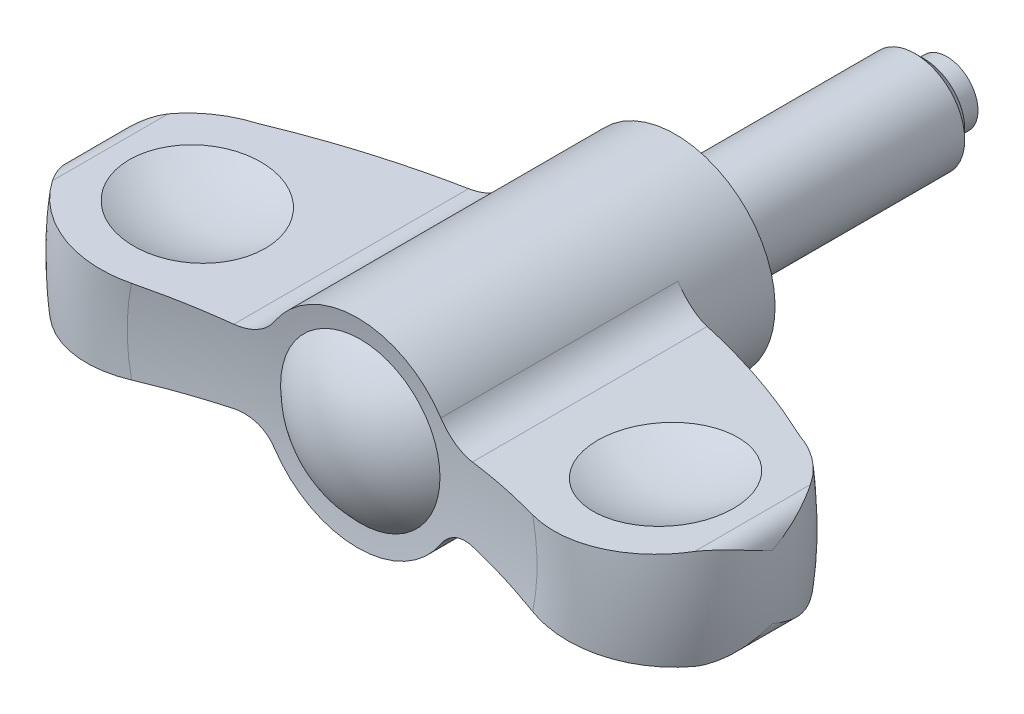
ISO-10303-21;
HEADER;
FILE_DESCRIPTION(('STEP AP214'),'2;1');
FILE_NAME('part.step','',(''),(''),'','','');
FILE_SCHEMA(('AUTOMOTIVE_DESIGN { 1 0 10303 214 1 1 1 1 }'));
ENDSEC;
DATA;
#1=APPLICATION_CONTEXT('core data for automotive mechanical design processes');
#2=APPLICATION_PROTOCOL_DEFINITION('international standard','automotive_design',2000,#1);
#3=PRODUCT_CONTEXT('',#1,'mechanical');
#4=PRODUCT('Part','Part','',(#3));
#5=PRODUCT_RELATED_PRODUCT_CATEGORY('part','',(#4));
#6=PRODUCT_DEFINITION_FORMATION('','',#4);
#7=PRODUCT_DEFINITION_CONTEXT('part definition',#1,'design');
#8=PRODUCT_DEFINITION('design','',#6,#7);
#9=PRODUCT_DEFINITION_SHAPE('','',#8);
#10=(LENGTH_UNIT() NAMED_UNIT(*) SI_UNIT(.MILLI.,.METRE.));
#11=(NAMED_UNIT(*) PLANE_ANGLE_UNIT() SI_UNIT($,.RADIAN.));
#12=(NAMED_UNIT(*) SI_UNIT($,.STERADIAN.) SOLID_ANGLE_UNIT());
#13=UNCERTAINTY_MEASURE_WITH_UNIT(LENGTH_MEASURE(1.E-05),#10,'distance_accuracy_value','');
#14=(GEOMETRIC_REPRESENTATION_CONTEXT(3) GLOBAL_UNCERTAINTY_ASSIGNED_CONTEXT((#13)) GLOBAL_UNIT_ASSIGNED_CONTEXT((#10,
#11,#12)) REPRESENTATION_CONTEXT('',''));
#15=CARTESIAN_POINT('',(0.,0.,0.));
#16=DIRECTION('',(0.,0.,1.));
#17=DIRECTION('',(1.,0.,0.));
#18=AXIS2_PLACEMENT_3D('',#15,#16,#17);
#19=CARTESIAN_POINT('',(0.,0.,69.5304878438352));
#20=DIRECTION('',(0.,0.,-1.));
#21=DIRECTION('',(0.,-1.,0.));
#22=AXIS2_PLACEMENT_3D('',#19,#20,#21);
#23=DEGENERATE_TOROIDAL_SURFACE('',#22,7.49460900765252,64.9070512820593,.F.);
#24=CARTESIAN_POINT('',(-9.5830790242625,-2.93702964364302,7.03203264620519));
#25=CARTESIAN_POINT('',(-9.49355041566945,-2.93115210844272,7.00755849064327));
#26=CARTESIAN_POINT('',(-9.40369287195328,-2.92903508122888,6.98351825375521));
#27=CARTESIAN_POINT('',(-9.22383334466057,-2.93238697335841,6.93647279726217));
#28=CARTESIAN_POINT('',(-9.13383133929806,-2.93785717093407,6.91346775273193));
#29=CARTESIAN_POINT('',(-8.86443408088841,-2.96574613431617,6.84627082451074));
#30=CARTESIAN_POINT('',(-8.68563801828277,-2.99964263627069,6.80389452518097));
#31=CARTESIAN_POINT('',(-8.33468130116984,-3.09795206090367,6.72559304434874));
#32=CARTESIAN_POINT('',(-8.16253484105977,-3.16242674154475,6.68968112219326));
#33=CARTESIAN_POINT('',(-7.91382689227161,-3.28094110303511,6.64198952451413));
#34=CARTESIAN_POINT('',(-7.83251517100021,-3.32407563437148,6.62712257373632));
#35=CARTESIAN_POINT('',(-7.67364428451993,-3.4173705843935,6.5996195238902));
#36=CARTESIAN_POINT('',(-7.59608369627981,-3.46752831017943,6.58698257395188));
#37=CARTESIAN_POINT('',(-7.44000595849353,-3.57835722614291,6.56330260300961));
#38=CARTESIAN_POINT('',(-7.3618120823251,-3.63952209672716,6.55243652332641));
#39=CARTESIAN_POINT('',(-7.21124113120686,-3.76905307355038,6.53364968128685));
#40=CARTESIAN_POINT('',(-7.13886437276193,-3.83741957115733,6.52572907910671));
#41=CARTESIAN_POINT('',(-7.00026291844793,-3.9811799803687,6.5129447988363));
#42=CARTESIAN_POINT('',(-6.93407706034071,-4.05661299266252,6.50809944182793));
#43=CARTESIAN_POINT('',(-6.80899054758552,-4.21345237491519,6.50161981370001));
#44=CARTESIAN_POINT('',(-6.75009171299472,-4.29486022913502,6.49998634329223));
#45=CARTESIAN_POINT('',(-6.69517692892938,-4.3788818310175,6.50000000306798));
#46=B_SPLINE_CURVE_WITH_KNOTS('',3,(#24,#25,#26,#27,#28,#29,#30,#31,#32,#33,#34,#35,#36,#37,#38,
#39,#40,#41,#42,#43,#44,#45),.UNSPECIFIED.,.F.,.F.,(4,2,2,2,2,2,2,2,2,2,4),(0.,
0.278847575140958,0.557742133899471,1.11550180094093,1.67439278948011,1.95379713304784,
2.23309463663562,2.53222799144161,2.83137761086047,3.1322931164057,3.43328362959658),.UNSPECIFIED.);
#47=CARTESIAN_POINT('',(-9.5828790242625,-2.9370165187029,7.03197797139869));
#48=VERTEX_POINT('',#47);
#49=CARTESIAN_POINT('',(-6.6953077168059,-4.3786818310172,6.5));
#50=VERTEX_POINT('',#49);
#51=EDGE_CURVE('E156',#48,#50,#46,.T.);
#52=ORIENTED_EDGE('',*,*,#51,.F.);
#53=CARTESIAN_POINT('',(-21.7147583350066,-3.73278589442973,11.728840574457));
#54=CARTESIAN_POINT('',(-20.7455729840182,-3.66921387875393,11.2353807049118));
#55=CARTESIAN_POINT('',(-19.7639491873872,-3.60482598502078,10.7664976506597));
#56=CARTESIAN_POINT('',(-17.7808383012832,-3.47474729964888,9.88027246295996));
#57=CARTESIAN_POINT('',(-16.7794089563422,-3.40906029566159,9.46280054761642));
#58=CARTESIAN_POINT('',(-14.7566498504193,-3.27638095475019,8.67921714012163));
#59=CARTESIAN_POINT('',(-13.7353195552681,-3.2093885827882,8.3131070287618));
#60=CARTESIAN_POINT('',(-12.1890970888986,-3.10796682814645,7.80307389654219));
#61=CARTESIAN_POINT('',(-11.6706211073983,-3.07395830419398,7.63939380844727));
#62=CARTESIAN_POINT('',(-10.6296198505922,-3.00567564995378,7.32550375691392));
#63=CARTESIAN_POINT('',(-10.1070945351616,-2.97140151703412,7.17529392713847));
#64=CARTESIAN_POINT('',(-9.58267902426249,-2.93700340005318,7.03192329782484));
#65=B_SPLINE_CURVE_WITH_KNOTS('',3,(#53,#54,#55,#56,#57,#58,#59,#60,#61,#62,#63,#64),
.UNSPECIFIED.,.F.,.F.,(4,2,2,2,2,4),(0.,3.26791037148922,6.52739436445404,9.78696596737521,
11.4210933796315,13.0552370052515),.UNSPECIFIED.);
#66=CARTESIAN_POINT('',(-21.7143655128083,-3.73276012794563,11.728640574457));
#67=VERTEX_POINT('',#66);
#68=EDGE_CURVE('E201',#67,#48,#65,.T.);
#69=ORIENTED_EDGE('',*,*,#68,.F.);
#70=CARTESIAN_POINT('',(0.,0.,11.728640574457));
#71=DIRECTION('',(0.,0.,-1.));
#72=DIRECTION('',(0.,-1.,0.));
#73=AXIS2_PLACEMENT_3D('',#70,#71,#72);
#74=CIRCLE('',#73,22.032865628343);
#75=CARTESIAN_POINT('',(-21.7143655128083,3.73276012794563,11.728640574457));
#76=VERTEX_POINT('',#75);
#77=EDGE_CURVE('E469',#67,#76,#74,.T.);
#78=ORIENTED_EDGE('',*,*,#77,.T.);
#79=CARTESIAN_POINT('',(-9.5826790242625,2.93700340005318,7.03192329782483));
#80=CARTESIAN_POINT('',(-9.9949048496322,2.9640426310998,7.14461627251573));
#81=CARTESIAN_POINT('',(-10.4059768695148,2.99100618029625,7.26154651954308));
#82=CARTESIAN_POINT('',(-11.2256260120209,3.044769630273,7.50375221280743));
#83=CARTESIAN_POINT('',(-11.6342033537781,3.07156954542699,7.62902691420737));
#84=CARTESIAN_POINT('',(-12.8561119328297,3.15171849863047,8.01723343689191));
#85=CARTESIAN_POINT('',(-13.6655290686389,3.20481079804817,8.29252285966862));
#86=CARTESIAN_POINT('',(-16.069800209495,3.36251475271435,9.16445877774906));
#87=CARTESIAN_POINT('',(-17.6477654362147,3.4660186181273,9.8091195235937));
#88=CARTESIAN_POINT('',(-19.6208518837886,3.59543976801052,10.7081143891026));
#89=CARTESIAN_POINT('',(-20.0424264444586,3.62309221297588,10.9057530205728));
#90=CARTESIAN_POINT('',(-20.8816689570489,3.67814085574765,11.310357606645));
#91=CARTESIAN_POINT('',(-21.2993320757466,3.7055367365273,11.5173336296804));
#92=CARTESIAN_POINT('',(-21.7147583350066,3.73278589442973,11.728840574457));
#93=B_SPLINE_CURVE_WITH_KNOTS('',3,(#79,#80,#81,#82,#83,#84,#85,#86,#87,#88,#89,#90,#91,#92),
.UNSPECIFIED.,.F.,.F.,(4,2,2,2,2,2,4),(0.,1.28459760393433,2.56908069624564,5.13832917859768,
10.2547803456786,11.6539949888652,13.0547562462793),.UNSPECIFIED.);
#94=CARTESIAN_POINT('',(-9.5828790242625,2.9370165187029,7.03197797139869));
#95=VERTEX_POINT('',#94);
#96=EDGE_CURVE('E262',#95,#76,#93,.T.);
#97=ORIENTED_EDGE('',*,*,#96,.F.);
#98=CARTESIAN_POINT('',(-6.6951769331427,4.37888182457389,6.50000000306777));
#99=CARTESIAN_POINT('',(-6.74261015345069,4.30632098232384,6.49999187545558));
#100=CARTESIAN_POINT('',(-6.79300686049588,4.2357050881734,6.50120778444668));
#101=CARTESIAN_POINT('',(-6.89930475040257,4.0988526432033,6.50604301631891));
#102=CARTESIAN_POINT('',(-6.95520494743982,4.03261531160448,6.50966190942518));
#103=CARTESIAN_POINT('',(-7.07195291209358,3.9051487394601,6.51924602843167));
#104=CARTESIAN_POINT('',(-7.13278746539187,3.84390694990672,6.52520514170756));
#105=CARTESIAN_POINT('',(-7.25903794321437,3.72666244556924,6.53937999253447));
#106=CARTESIAN_POINT('',(-7.32445392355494,3.67065979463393,6.54759575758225));
#107=CARTESIAN_POINT('',(-7.52682049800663,3.51109690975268,6.57547100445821));
#108=CARTESIAN_POINT('',(-7.67002421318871,3.41583549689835,6.59836973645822));
#109=CARTESIAN_POINT('',(-7.96872509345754,3.24986585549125,6.65168714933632));
#110=CARTESIAN_POINT('',(-8.12423083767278,3.17917495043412,6.68211111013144));
#111=CARTESIAN_POINT('',(-8.447410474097,3.06212812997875,6.75007257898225));
#112=CARTESIAN_POINT('',(-8.61529569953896,3.01645328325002,6.78777458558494));
#113=CARTESIAN_POINT('',(-8.95489583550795,2.95295409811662,6.8683254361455));
#114=CARTESIAN_POINT('',(-9.12660576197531,2.93509544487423,6.9111678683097));
#115=CARTESIAN_POINT('',(-9.34558614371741,2.92991895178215,6.96829133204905));
#116=CARTESIAN_POINT('',(-9.39321883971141,2.92986109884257,6.98086778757));
#117=CARTESIAN_POINT('',(-9.48828894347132,2.93186482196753,7.00626622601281));
#118=CARTESIAN_POINT('',(-9.53572654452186,2.93392285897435,7.01908776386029));
#119=CARTESIAN_POINT('',(-9.5830790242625,2.93702964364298,7.03203264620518));
#120=B_SPLINE_CURVE_WITH_KNOTS('',3,(#98,#99,#100,#101,#102,#103,#104,#105,#106,#107,#108,#109,
#110,#111,#112,#113,#114,#115,#116,#117,#118,#119),.UNSPECIFIED.,.F.,.F.,(4,2,2,2,2,2,2,2,2,2,
4),(0.,0.259976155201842,0.519905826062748,0.779161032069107,1.03841939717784,1.55634664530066,
2.07463832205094,2.60641616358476,3.13753746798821,3.28530352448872,3.43282282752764),.UNSPECIFIED.);
#121=CARTESIAN_POINT('',(-6.6953077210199,4.3786818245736,6.5));
#122=VERTEX_POINT('',#121);
#123=EDGE_CURVE('E254',#122,#95,#120,.T.);
#124=ORIENTED_EDGE('',*,*,#123,.F.);
#125=CARTESIAN_POINT('',(0.,0.,6.5));
#126=DIRECTION('',(0.,0.,-1.));
#127=DIRECTION('',(0.,-1.,0.));
#128=AXIS2_PLACEMENT_3D('',#125,#126,#127);
#129=CIRCLE('',#128,8.);
#130=EDGE_CURVE('E462',#50,#122,#129,.T.);
#131=ORIENTED_EDGE('',*,*,#130,.F.);
#132=EDGE_LOOP('',(#52,#69,#78,#97,#124,#131));
#133=FACE_BOUND('',#132,.T.);
#134=ADVANCED_FACE('F14',(#133),#23,.F.);
#135=CARTESIAN_POINT('',(0.,0.,19.5999999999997));
#136=DIRECTION('',(0.,0.,-1.));
#137=DIRECTION('',(0.,-1.,0.));
#138=AXIS2_PLACEMENT_3D('',#135,#136,#137);
#139=TOROIDAL_SURFACE('',#138,19.0999999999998,8.39999999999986);
#140=CARTESIAN_POINT('',(-15.8176496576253,-3.34597537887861,11.728440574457));
#141=CARTESIAN_POINT('',(-15.592439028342,-3.33120308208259,11.8116339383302));
#142=CARTESIAN_POINT('',(-15.3707437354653,-3.31666136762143,11.9043704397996));
#143=CARTESIAN_POINT('',(-14.9359126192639,-3.2881393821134,12.1081679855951));
#144=CARTESIAN_POINT('',(-14.722776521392,-3.27415909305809,12.219228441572));
#145=CARTESIAN_POINT('',(-14.3066280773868,-3.24686256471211,12.4588887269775));
#146=CARTESIAN_POINT('',(-14.1036133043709,-3.23354616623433,12.587484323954));
#147=CARTESIAN_POINT('',(-13.709098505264,-3.20766865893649,12.8613308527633));
#148=CARTESIAN_POINT('',(-13.5175983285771,-3.19510754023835,13.0065815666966));
#149=CARTESIAN_POINT('',(-13.147420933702,-3.17082640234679,13.3127951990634));
#150=CARTESIAN_POINT('',(-12.9687485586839,-3.15910670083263,13.4737639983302));
#151=CARTESIAN_POINT('',(-12.6255559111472,-3.13659558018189,13.8103172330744));
#152=CARTESIAN_POINT('',(-12.4610405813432,-3.12580448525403,13.985906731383));
#153=CARTESIAN_POINT('',(-12.1475342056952,-3.10524058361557,14.3503624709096));
#154=CARTESIAN_POINT('',(-11.9985364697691,-3.09546733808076,14.5392229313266));
#155=CARTESIAN_POINT('',(-11.7171356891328,-3.07700934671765,14.9289756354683));
#156=CARTESIAN_POINT('',(-11.5847323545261,-3.0683245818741,15.1298676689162));
#157=CARTESIAN_POINT('',(-11.3383545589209,-3.05216386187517,15.5409759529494));
#158=CARTESIAN_POINT('',(-11.2242691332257,-3.04468062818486,15.751125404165));
#159=CARTESIAN_POINT('',(-11.014497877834,-3.03092105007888,16.1803595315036));
#160=CARTESIAN_POINT('',(-10.9188051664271,-3.02464425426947,16.3994408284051));
#161=CARTESIAN_POINT('',(-10.7465617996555,-3.01334625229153,16.8450927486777));
#162=CARTESIAN_POINT('',(-10.6700153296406,-3.00832532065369,17.0716649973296));
#163=CARTESIAN_POINT('',(-10.5367692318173,-2.99958527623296,17.53059677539));
#164=CARTESIAN_POINT('',(-10.4800692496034,-2.99586614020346,17.7629562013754));
#165=CARTESIAN_POINT('',(-10.3879653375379,-2.98982474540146,18.22703267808));
#166=CARTESIAN_POINT('',(-10.3521573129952,-2.98747598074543,18.4586692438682));
#167=CARTESIAN_POINT('',(-10.3004173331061,-2.98408218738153,18.9241606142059));
#168=CARTESIAN_POINT('',(-10.2844851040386,-2.9830371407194,19.1580153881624));
#169=CARTESIAN_POINT('',(-10.2726425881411,-2.98226035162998,19.626199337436));
#170=CARTESIAN_POINT('',(-10.2767294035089,-2.98252841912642,19.8605284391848));
#171=CARTESIAN_POINT('',(-10.3048809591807,-2.98437497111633,20.3279772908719));
#172=CARTESIAN_POINT('',(-10.3289455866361,-2.98595344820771,20.5610970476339));
#173=CARTESIAN_POINT('',(-10.3963472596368,-2.99037454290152,21.0211094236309));
#174=CARTESIAN_POINT('',(-10.4394036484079,-2.9931987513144,21.2480434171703));
#175=CARTESIAN_POINT('',(-10.5443594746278,-3.00008314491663,21.697577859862));
#176=CARTESIAN_POINT('',(-10.6062657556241,-3.00414377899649,21.9201767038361));
#177=CARTESIAN_POINT('',(-10.7483844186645,-3.01346580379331,22.359389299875));
#178=CARTESIAN_POINT('',(-10.8285943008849,-3.01872703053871,22.5760038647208));
#179=CARTESIAN_POINT('',(-11.0066740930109,-3.03040786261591,23.0018204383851));
#180=CARTESIAN_POINT('',(-11.104544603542,-3.03682750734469,23.2110221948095));
#181=CARTESIAN_POINT('',(-11.3181804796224,-3.05084057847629,23.6225509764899));
#182=CARTESIAN_POINT('',(-11.4341060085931,-3.05844451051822,23.8247944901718));
#183=CARTESIAN_POINT('',(-11.6822785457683,-3.07472295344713,24.2189646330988));
#184=CARTESIAN_POINT('',(-11.8145259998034,-3.08339749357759,24.4108909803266));
#185=CARTESIAN_POINT('',(-12.0943438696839,-3.10175165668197,24.7831438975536));
#186=CARTESIAN_POINT('',(-12.2419127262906,-3.11143117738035,24.963471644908));
#187=CARTESIAN_POINT('',(-12.5513728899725,-3.13172967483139,25.311433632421));
#188=CARTESIAN_POINT('',(-12.7132689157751,-3.14234896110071,25.4790636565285));
#189=CARTESIAN_POINT('',(-13.0536697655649,-3.16467695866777,25.8037821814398));
#190=CARTESIAN_POINT('',(-13.2324473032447,-3.17640355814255,25.9605836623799));
#191=CARTESIAN_POINT('',(-13.6024189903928,-3.20067120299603,26.2587128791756));
#192=CARTESIAN_POINT('',(-13.7936133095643,-3.21321225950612,26.4000404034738));
#193=CARTESIAN_POINT('',(-14.1871148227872,-3.23902330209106,26.6662926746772));
#194=CARTESIAN_POINT('',(-14.3894244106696,-3.25229344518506,26.7912138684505));
#195=CARTESIAN_POINT('',(-14.8036419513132,-3.2794633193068,27.0237267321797));
#196=CARTESIAN_POINT('',(-15.0155468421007,-3.29336284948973,27.1313238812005));
#197=CARTESIAN_POINT('',(-15.4501454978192,-3.32186958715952,27.3296783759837));
#198=CARTESIAN_POINT('',(-15.6729382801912,-3.33648328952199,27.4202179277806));
#199=CARTESIAN_POINT('',(-16.1253338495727,-3.36615738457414,27.5821830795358));
#200=CARTESIAN_POINT('',(-16.3549365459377,-3.38121777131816,27.6536089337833));
#201=CARTESIAN_POINT('',(-16.8193402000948,-3.41167951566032,27.7768258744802));
#202=CARTESIAN_POINT('',(-17.0541413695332,-3.42708088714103,27.8286161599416));
#203=CARTESIAN_POINT('',(-17.5272621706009,-3.45811441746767,27.9121632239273));
#204=CARTESIAN_POINT('',(-17.765581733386,-3.47374657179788,27.9439203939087));
#205=CARTESIAN_POINT('',(-18.2440929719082,-3.50513367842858,27.9871504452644));
#206=CARTESIAN_POINT('',(-18.4842849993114,-3.52088865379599,27.9986194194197));
#207=CARTESIAN_POINT('',(-18.9646922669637,-3.55240012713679,28.0011454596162));
#208=CARTESIAN_POINT('',(-19.2049074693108,-3.56815662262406,27.9922097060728));
#209=CARTESIAN_POINT('',(-19.6837359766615,-3.5995645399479,27.953969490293));
#210=CARTESIAN_POINT('',(-19.922349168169,-3.61521595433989,27.924663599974));
#211=CARTESIAN_POINT('',(-20.3962313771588,-3.64629942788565,27.8458582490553));
#212=CARTESIAN_POINT('',(-20.6315004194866,-3.66173148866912,27.796358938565));
#213=CARTESIAN_POINT('',(-21.0956069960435,-3.69217374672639,27.677843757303));
#214=CARTESIAN_POINT('',(-21.3244743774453,-3.70718590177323,27.608945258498));
#215=CARTESIAN_POINT('',(-21.775567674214,-3.73677457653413,27.451976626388));
#216=CARTESIAN_POINT('',(-21.9977935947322,-3.7513510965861,27.3639065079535));
#217=CARTESIAN_POINT('',(-22.4340985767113,-3.7799697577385,27.1691523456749));
#218=CARTESIAN_POINT('',(-22.6481736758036,-3.79401163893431,27.062459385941));
#219=CARTESIAN_POINT('',(-23.066497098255,-3.82145083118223,26.8312368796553));
#220=CARTESIAN_POINT('',(-23.2707458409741,-3.83484816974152,26.7067080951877));
#221=CARTESIAN_POINT('',(-23.666822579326,-3.86082812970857,26.4414333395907));
#222=CARTESIAN_POINT('',(-23.858713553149,-3.87341488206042,26.3007817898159));
#223=CARTESIAN_POINT('',(-24.2299141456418,-3.89776313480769,26.0036989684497));
#224=CARTESIAN_POINT('',(-24.409224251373,-3.90952466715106,25.8472683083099));
#225=CARTESIAN_POINT('',(-24.7536382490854,-3.93211590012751,25.520047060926));
#226=CARTESIAN_POINT('',(-24.9187678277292,-3.94294728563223,25.3492835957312));
#227=CARTESIAN_POINT('',(-25.2339249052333,-3.96361946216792,24.9944249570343));
#228=CARTESIAN_POINT('',(-25.3839616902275,-3.97346086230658,24.8103381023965));
#229=CARTESIAN_POINT('',(-25.5714137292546,-3.98575645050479,24.5593365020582));
#230=CARTESIAN_POINT('',(-25.6160937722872,-3.98868715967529,24.4977802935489));
#231=CARTESIAN_POINT('',(-25.7037200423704,-3.99443485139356,24.3735391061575));
#232=CARTESIAN_POINT('',(-25.7466680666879,-3.99725195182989,24.3108554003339));
#233=CARTESIAN_POINT('',(-25.788763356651,-4.00001311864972,24.2475919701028));
#234=B_SPLINE_CURVE_WITH_KNOTS('',3,(#140,#141,#142,#143,#144,#145,#146,#147,#148,#149,#150,
#151,#152,#153,#154,#155,#156,#157,#158,#159,#160,#161,#162,#163,#164,#165,#166,#167,#168,#169,
#170,#171,#172,#173,#174,#175,#176,#177,#178,#179,#180,#181,#182,#183,#184,#185,#186,#187,#188,
#189,#190,#191,#192,#193,#194,#195,#196,#197,#198,#199,#200,#201,#202,#203,#204,#205,#206,#207,
#208,#209,#210,#211,#212,#213,#214,#215,#216,#217,#218,#219,#220,#221,#222,#223,#224,#225,#226,
#227,#228,#229,#230,#231,#232,#233),.UNSPECIFIED.,.F.,.F.,(4,2,2,2,2,2,2,2,2,2,2,2,2,2,2,2,2,2,
2,2,2,2,2,2,2,2,2,2,2,2,2,2,2,2,2,2,2,2,2,2,2,2,2,2,2,2,4),(0.,0.721398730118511,
1.44277430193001,2.16397606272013,2.88516838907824,3.60663158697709,4.32834565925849,
5.04974728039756,5.77113629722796,6.4879754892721,7.20454594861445,7.92127291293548,
8.63798707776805,9.34033480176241,10.0426728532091,10.7449092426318,11.4471416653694,
12.1393272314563,12.8317643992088,13.5241070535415,14.2164732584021,14.9153735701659,
15.6142929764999,16.313141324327,17.012220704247,17.725650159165,18.4390893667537,
19.1526828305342,19.8660501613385,20.5879860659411,21.3099123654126,22.0318681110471,
22.7538097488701,23.4758904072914,24.197717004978,24.9195942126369,25.6414660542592,
26.3590608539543,27.0766550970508,27.7945938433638,28.5125019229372,29.2264019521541,
29.9402743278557,30.6528250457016,31.3649346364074,31.5932709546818,31.8213638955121),.UNSPECIFIED.);
#235=CARTESIAN_POINT('',(-16.1118579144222,-3.36527345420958,27.574212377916));
#236=VERTEX_POINT('',#235);
#237=CARTESIAN_POINT('',(-25.788563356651,-4.,24.2478925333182));
#238=VERTEX_POINT('',#237);
#239=EDGE_CURVE('E270',#236,#238,#234,.T.);
#240=ORIENTED_EDGE('',*,*,#239,.F.);
#241=CARTESIAN_POINT('',(0.,0.,27.574212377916));
#242=DIRECTION('',(0.,0.,-1.));
#243=DIRECTION('',(0.,-1.,0.));
#244=AXIS2_PLACEMENT_3D('',#241,#242,#243);
#245=CIRCLE('',#244,16.459557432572);
#246=CARTESIAN_POINT('',(-16.1118579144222,3.36527345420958,27.574212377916));
#247=VERTEX_POINT('',#246);
#248=EDGE_CURVE('E207',#236,#247,#245,.T.);
#249=ORIENTED_EDGE('',*,*,#248,.T.);
#250=CARTESIAN_POINT('',(-25.788763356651,4.00001311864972,24.2475919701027));
#251=CARTESIAN_POINT('',(-25.6577100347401,3.99141690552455,24.4445970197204));
#252=CARTESIAN_POINT('',(-25.5182985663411,3.98227245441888,24.6360103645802));
#253=CARTESIAN_POINT('',(-25.2238672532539,3.96295974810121,25.006355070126));
#254=CARTESIAN_POINT('',(-25.0688484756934,3.95279156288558,25.1852872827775));
#255=CARTESIAN_POINT('',(-24.7444385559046,3.93151246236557,25.5292433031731));
#256=CARTESIAN_POINT('',(-24.575060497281,3.92040240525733,25.6942795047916));
#257=CARTESIAN_POINT('',(-24.2230386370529,3.8973121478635,26.0094684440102));
#258=CARTESIAN_POINT('',(-24.0403949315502,3.88533195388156,26.159621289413));
#259=CARTESIAN_POINT('',(-23.6630826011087,3.86058281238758,26.4440460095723));
#260=CARTESIAN_POINT('',(-23.4684097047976,3.84781358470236,26.5783121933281));
#261=CARTESIAN_POINT('',(-23.068488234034,3.8215814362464,26.8299733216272));
#262=CARTESIAN_POINT('',(-22.8632394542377,3.80811850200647,26.9473679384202));
#263=CARTESIAN_POINT('',(-22.4436655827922,3.78059728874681,27.1644600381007));
#264=CARTESIAN_POINT('',(-22.2293418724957,3.76653910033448,27.2641602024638));
#265=CARTESIAN_POINT('',(-21.7931120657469,3.73792537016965,27.4452089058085));
#266=CARTESIAN_POINT('',(-21.5712059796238,3.72336982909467,27.5265574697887));
#267=CARTESIAN_POINT('',(-21.1206337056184,3.69381532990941,27.6705991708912));
#268=CARTESIAN_POINT('',(-20.8919475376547,3.67881506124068,27.73322953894));
#269=CARTESIAN_POINT('',(-20.4300628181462,3.64851854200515,27.8390784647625));
#270=CARTESIAN_POINT('',(-20.1968627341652,3.63322219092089,27.8822903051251));
#271=CARTESIAN_POINT('',(-19.7276769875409,3.60244677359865,27.9489987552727));
#272=CARTESIAN_POINT('',(-19.491691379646,3.5869677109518,27.972495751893));
#273=CARTESIAN_POINT('',(-19.0185821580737,3.55593494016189,27.9996449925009));
#274=CARTESIAN_POINT('',(-18.7814585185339,3.54038123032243,28.0032967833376));
#275=CARTESIAN_POINT('',(-18.3062787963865,3.50921264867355,27.9907230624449));
#276=CARTESIAN_POINT('',(-18.0682259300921,3.49359798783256,27.9743753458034));
#277=CARTESIAN_POINT('',(-17.5943200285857,3.46251296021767,27.9217427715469));
#278=CARTESIAN_POINT('',(-17.3584670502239,3.44704259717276,27.8854574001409));
#279=CARTESIAN_POINT('',(-16.8906665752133,3.41635804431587,27.7932416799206));
#280=CARTESIAN_POINT('',(-16.6587183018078,3.4011438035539,27.737315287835));
#281=CARTESIAN_POINT('',(-16.2002232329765,3.37106962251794,27.6062097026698));
#282=CARTESIAN_POINT('',(-15.9736782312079,3.35620979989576,27.5310242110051));
#283=CARTESIAN_POINT('',(-15.5262824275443,3.32686365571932,27.3614335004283));
#284=CARTESIAN_POINT('',(-15.3054749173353,3.31238017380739,27.2669135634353));
#285=CARTESIAN_POINT('',(-14.8725641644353,3.28398415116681,27.0596173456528));
#286=CARTESIAN_POINT('',(-14.6604609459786,3.27007161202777,26.9468410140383));
#287=CARTESIAN_POINT('',(-14.2464132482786,3.24291287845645,26.7037979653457));
#288=CARTESIAN_POINT('',(-14.044471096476,3.22966683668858,26.5735272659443));
#289=CARTESIAN_POINT('',(-13.6523023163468,3.20394321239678,26.2964676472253));
#290=CARTESIAN_POINT('',(-13.462071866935,3.19146537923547,26.1496841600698));
#291=CARTESIAN_POINT('',(-13.0941833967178,3.16733437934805,25.8402050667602));
#292=CARTESIAN_POINT('',(-12.9165567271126,3.155683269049,25.6774720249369));
#293=CARTESIAN_POINT('',(-12.5756939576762,3.13332497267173,25.3375195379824));
#294=CARTESIAN_POINT('',(-12.4124575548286,3.12261776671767,25.1603003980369));
#295=CARTESIAN_POINT('',(-12.1016007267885,3.10222765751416,24.7925972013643));
#296=CARTESIAN_POINT('',(-11.9539804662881,3.09254476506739,24.6021130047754));
#297=CARTESIAN_POINT('',(-11.6755090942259,3.07427892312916,24.2092140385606));
#298=CARTESIAN_POINT('',(-11.5446574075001,3.06569593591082,24.0067996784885));
#299=CARTESIAN_POINT('',(-11.3017883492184,3.04976536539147,23.5931960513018));
#300=CARTESIAN_POINT('',(-11.1896228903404,3.04240806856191,23.3820941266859));
#301=CARTESIAN_POINT('',(-10.9837731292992,3.02890571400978,22.9511259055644));
#302=CARTESIAN_POINT('',(-10.8900814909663,3.02276017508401,22.731263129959));
#303=CARTESIAN_POINT('',(-10.7219179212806,3.0117297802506,22.2842548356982));
#304=CARTESIAN_POINT('',(-10.6474473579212,3.00684501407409,22.0571087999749));
#305=CARTESIAN_POINT('',(-10.5183956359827,2.99838009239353,21.597211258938));
#306=CARTESIAN_POINT('',(-10.4638141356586,2.99479991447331,21.3644598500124));
#307=CARTESIAN_POINT('',(-10.3759343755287,2.98903559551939,20.8998212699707));
#308=CARTESIAN_POINT('',(-10.3422290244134,2.98682475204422,20.6680113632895));
#309=CARTESIAN_POINT('',(-10.2946940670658,2.98370677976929,20.2023545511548));
#310=CARTESIAN_POINT('',(-10.2808641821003,2.98279963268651,19.9685076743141));
#311=CARTESIAN_POINT('',(-10.2732062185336,2.98229732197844,19.5005025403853));
#312=CARTESIAN_POINT('',(-10.2793766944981,2.98270206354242,19.2663443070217));
#313=CARTESIAN_POINT('',(-10.3116599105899,2.98481962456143,18.7994136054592));
#314=CARTESIAN_POINT('',(-10.3377725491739,2.98653243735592,18.5666411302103));
#315=CARTESIAN_POINT('',(-10.4092059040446,2.99121798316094,18.1073705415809));
#316=CARTESIAN_POINT('',(-10.4542565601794,2.9941730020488,17.880830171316));
#317=CARTESIAN_POINT('',(-10.5631529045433,3.0013158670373,17.4322470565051));
#318=CARTESIAN_POINT('',(-10.6270053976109,3.0055041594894,17.2102059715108));
#319=CARTESIAN_POINT('',(-10.7729455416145,3.01507684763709,16.7722877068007));
#320=CARTESIAN_POINT('',(-10.8550288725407,3.02046095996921,16.5564090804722));
#321=CARTESIAN_POINT('',(-11.0367765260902,3.03238237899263,16.1322106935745));
#322=CARTESIAN_POINT('',(-11.1364415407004,3.03891973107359,15.923891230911));
#323=CARTESIAN_POINT('',(-11.3536372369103,3.05316630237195,15.5141908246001));
#324=CARTESIAN_POINT('',(-11.4713341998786,3.06088642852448,15.312898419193));
#325=CARTESIAN_POINT('',(-11.7229581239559,3.07739125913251,14.9207760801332));
#326=CARTESIAN_POINT('',(-11.8568851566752,3.08617596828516,14.7299461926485));
#327=CARTESIAN_POINT('',(-12.1400516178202,3.10474977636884,14.3599029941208));
#328=CARTESIAN_POINT('',(-12.2892990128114,3.11453939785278,14.1806958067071));
#329=CARTESIAN_POINT('',(-12.6019741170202,3.13504877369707,13.8351741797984));
#330=CARTESIAN_POINT('',(-12.7654017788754,3.14576852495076,13.668859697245));
#331=CARTESIAN_POINT('',(-13.1089754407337,3.16830463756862,13.3467486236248));
#332=CARTESIAN_POINT('',(-13.2894066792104,3.18013970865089,13.1912574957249));
#333=CARTESIAN_POINT('',(-13.662521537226,3.20461352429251,12.8959594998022));
#334=CARTESIAN_POINT('',(-13.8552007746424,3.2172519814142,12.7561470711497));
#335=CARTESIAN_POINT('',(-14.2512125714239,3.24322768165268,12.4932872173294));
#336=CARTESIAN_POINT('',(-14.4545292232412,3.25656388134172,12.3702156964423));
#337=CARTESIAN_POINT('',(-14.8705820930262,3.28385414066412,12.1414872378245));
#338=CARTESIAN_POINT('',(-15.0833128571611,3.29780784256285,12.0358203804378));
#339=CARTESIAN_POINT('',(-15.3851506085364,3.31760636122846,11.9012480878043));
#340=CARTESIAN_POINT('',(-15.4709196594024,3.32323223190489,11.8646802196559));
#341=CARTESIAN_POINT('',(-15.643498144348,3.33455221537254,11.7944158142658));
#342=CARTESIAN_POINT('',(-15.7303061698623,3.34024623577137,11.7607158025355));
#343=CARTESIAN_POINT('',(-15.8176496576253,3.34597537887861,11.728440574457));
#344=B_SPLINE_CURVE_WITH_KNOTS('',3,(#250,#251,#252,#253,#254,#255,#256,#257,#258,#259,#260,
#261,#262,#263,#264,#265,#266,#267,#268,#269,#270,#271,#272,#273,#274,#275,#276,#277,#278,#279,
#280,#281,#282,#283,#284,#285,#286,#287,#288,#289,#290,#291,#292,#293,#294,#295,#296,#297,#298,
#299,#300,#301,#302,#303,#304,#305,#306,#307,#308,#309,#310,#311,#312,#313,#314,#315,#316,#317,
#318,#319,#320,#321,#322,#323,#324,#325,#326,#327,#328,#329,#330,#331,#332,#333,#334,#335,#336,
#337,#338,#339,#340,#341,#342,#343),.UNSPECIFIED.,.F.,.F.,(4,2,2,2,2,2,2,2,2,2,2,2,2,2,2,2,2,2,
2,2,2,2,2,2,2,2,2,2,2,2,2,2,2,2,2,2,2,2,2,2,2,2,2,2,2,2,4),(0.,0.710088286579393,
1.42012805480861,2.12952767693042,2.83892216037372,3.54857000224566,4.25823162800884,
4.96778561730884,5.67733864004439,6.38924502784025,7.10139749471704,7.81353598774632,
8.52569074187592,9.24221886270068,9.958765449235,10.6751677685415,11.3918046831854,
12.112823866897,12.8338450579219,13.5550306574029,14.2759797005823,14.9986633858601,
15.7213318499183,16.4440079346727,17.1666592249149,17.8832788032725,18.5996132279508,
19.3159986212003,20.0323717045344,20.7342950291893,21.4362085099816,22.1380712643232,
22.83993044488,23.532103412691,24.2245272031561,24.9167870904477,25.609074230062,
26.3081792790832,27.0072874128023,27.7067609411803,28.4062321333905,29.1208388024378,
29.8351912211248,30.5485043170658,31.2614094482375,31.5415963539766,31.8214388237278),.UNSPECIFIED.);
#345=CARTESIAN_POINT('',(-25.788563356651,4.,24.2478925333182));
#346=VERTEX_POINT('',#345);
#347=EDGE_CURVE('E292',#346,#247,#344,.T.);
#348=ORIENTED_EDGE('',*,*,#347,.F.);
#349=CARTESIAN_POINT('',(-27.3816792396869,2.5482625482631,19.5999999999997));
#350=CARTESIAN_POINT('',(-27.3814470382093,2.55075771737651,19.6055723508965));
#351=CARTESIAN_POINT('',(-27.3812089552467,2.55325243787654,19.6111448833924));
#352=CARTESIAN_POINT('',(-27.3600015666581,2.77007441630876,20.0955732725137));
#353=CARTESIAN_POINT('',(-27.2956220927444,2.98092520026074,20.5757161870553));
#354=CARTESIAN_POINT('',(-27.1353355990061,3.27088713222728,21.291202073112));
#355=CARTESIAN_POINT('',(-27.0712358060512,3.36319776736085,21.5290353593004));
#356=CARTESIAN_POINT('',(-26.9218052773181,3.5352201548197,22.0027028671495));
#357=CARTESIAN_POINT('',(-26.8364849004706,3.61493802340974,22.2385380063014));
#358=CARTESIAN_POINT('',(-26.6785811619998,3.73185454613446,22.6245014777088));
#359=CARTESIAN_POINT('',(-26.6120713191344,3.77414678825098,22.7756024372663));
#360=CARTESIAN_POINT('',(-26.4704174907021,3.84966003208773,23.0759023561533));
#361=CARTESIAN_POINT('',(-26.3952804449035,3.88288825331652,23.2251027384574));
#362=CARTESIAN_POINT('',(-26.2362098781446,3.93842231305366,23.521823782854));
#363=CARTESIAN_POINT('',(-26.1522372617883,3.96067689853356,23.6693334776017));
#364=CARTESIAN_POINT('',(-26.0202447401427,3.98376869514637,23.8882514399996));
#365=CARTESIAN_POINT('',(-25.9751822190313,3.98975195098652,23.9609213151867));
#366=CARTESIAN_POINT('',(-25.8831625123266,3.99786728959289,24.105310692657));
#367=CARTESIAN_POINT('',(-25.8362045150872,3.99999770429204,24.177029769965));
#368=CARTESIAN_POINT('',(-25.7883633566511,3.99999998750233,24.2481900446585));
#369=B_SPLINE_CURVE_WITH_KNOTS('',3,(#349,#350,#351,#352,#353,#354,#355,#356,#357,#358,#359,
#360,#361,#362,#363,#364,#365,#366,#367,#368),.UNSPECIFIED.,.F.,.F.,(4,2,2,2,2,2,2,2,2,4),(0.,
0.0183303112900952,1.59343088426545,2.38182586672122,3.16983674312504,3.6807108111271,
4.19117677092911,4.70400482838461,4.96105475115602,5.21821593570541),.UNSPECIFIED.);
#370=CARTESIAN_POINT('',(-27.381679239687,2.5482625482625,19.5999999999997));
#371=VERTEX_POINT('',#370);
#372=EDGE_CURVE('E495',#371,#346,#369,.T.);
#373=ORIENTED_EDGE('',*,*,#372,.F.);
#374=CARTESIAN_POINT('',(-25.788363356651,3.9999999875,14.9518099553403));
#375=CARTESIAN_POINT('',(-25.8262339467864,4.00000140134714,15.0081410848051));
#376=CARTESIAN_POINT('',(-25.8635545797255,3.9986652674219,15.0648259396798));
#377=CARTESIAN_POINT('',(-25.9370280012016,3.99352324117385,15.1788190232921));
#378=CARTESIAN_POINT('',(-25.9731810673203,3.98971794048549,15.2361270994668));
#379=CARTESIAN_POINT('',(-26.0797021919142,3.97492063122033,15.4087198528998));
#380=CARTESIAN_POINT('',(-26.1482515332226,3.96054592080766,15.5248504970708));
#381=CARTESIAN_POINT('',(-26.2798587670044,3.92422749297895,15.758344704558));
#382=CARTESIAN_POINT('',(-26.3429380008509,3.90231501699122,15.8757012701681));
#383=CARTESIAN_POINT('',(-26.4637684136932,3.85202649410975,16.1118228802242));
#384=CARTESIAN_POINT('',(-26.5215166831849,3.82364694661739,16.2305886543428));
#385=CARTESIAN_POINT('',(-26.6683904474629,3.74054142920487,16.5491404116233));
#386=CARTESIAN_POINT('',(-26.7526320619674,3.68089872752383,16.7499241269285));
#387=CARTESIAN_POINT('',(-26.9055854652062,3.54995730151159,17.1535346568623));
#388=CARTESIAN_POINT('',(-26.9742898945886,3.47865308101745,17.3563623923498));
#389=CARTESIAN_POINT('',(-27.1571312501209,3.25138843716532,17.9676801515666));
#390=CARTESIAN_POINT('',(-27.2478257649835,3.08218354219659,18.3786338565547));
#391=CARTESIAN_POINT('',(-27.325688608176,2.84816243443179,18.9221003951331));
#392=CARTESIAN_POINT('',(-27.3413470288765,2.7904146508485,19.0543464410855));
#393=CARTESIAN_POINT('',(-27.3660874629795,2.67379406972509,19.3188310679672));
#394=CARTESIAN_POINT('',(-27.3751771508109,2.61492266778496,19.4510694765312));
#395=CARTESIAN_POINT('',(-27.381208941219,2.55325250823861,19.5888549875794));
#396=CARTESIAN_POINT('',(-27.3814470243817,2.55075778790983,19.5944275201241));
#397=CARTESIAN_POINT('',(-27.3816792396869,2.5482625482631,19.5999999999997));
#398=B_SPLINE_CURVE_WITH_KNOTS('',3,(#374,#375,#376,#377,#378,#379,#380,#381,#382,#383,#384,
#385,#386,#387,#388,#389,#390,#391,#392,#393,#394,#395,#396,#397),.UNSPECIFIED.,.F.,.F.,(4,2,2,
2,2,2,2,2,2,2,2,4),(0.,0.203594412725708,0.407140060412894,0.813591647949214,1.21837853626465,
1.62338505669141,2.2995999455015,2.97613446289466,4.33045572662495,4.76586348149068,
5.20076171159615,5.21909202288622),.UNSPECIFIED.);
#399=CARTESIAN_POINT('',(-25.788563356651,4.,14.9521074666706));
#400=VERTEX_POINT('',#399);
#401=EDGE_CURVE('E493',#400,#371,#398,.T.);
#402=ORIENTED_EDGE('',*,*,#401,.F.);
#403=CARTESIAN_POINT('',(-21.7138268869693,3.73272479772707,11.728440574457));
#404=CARTESIAN_POINT('',(-21.9384901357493,3.74746119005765,11.8118230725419));
#405=CARTESIAN_POINT('',(-22.1595961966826,3.76196425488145,11.9048358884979));
#406=CARTESIAN_POINT('',(-22.5931300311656,3.79040114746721,12.1093676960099));
#407=CARTESIAN_POINT('',(-22.8055573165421,3.8043349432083,12.2208877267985));
#408=CARTESIAN_POINT('',(-23.2148057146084,3.83117887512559,12.4585695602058));
#409=CARTESIAN_POINT('',(-23.4118878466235,3.84410613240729,12.5842803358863));
#410=CARTESIAN_POINT('',(-23.7949167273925,3.86923024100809,12.8516751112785));
#411=CARTESIAN_POINT('',(-23.9808652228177,3.88142720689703,12.9933565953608));
#412=CARTESIAN_POINT('',(-24.3154435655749,3.90337328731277,13.2710653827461));
#413=CARTESIAN_POINT('',(-24.4656760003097,3.91322752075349,13.4051600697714));
#414=CARTESIAN_POINT('',(-24.7561477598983,3.93228050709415,13.6838126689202));
#415=CARTESIAN_POINT('',(-24.8963873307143,3.94147927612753,13.8283703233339));
#416=CARTESIAN_POINT('',(-25.1692026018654,3.95937411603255,14.1306123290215));
#417=CARTESIAN_POINT('',(-25.3015315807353,3.96805400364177,14.2885203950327));
#418=CARTESIAN_POINT('',(-25.5542714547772,3.98463203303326,14.6136774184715));
#419=CARTESIAN_POINT('',(-25.6746806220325,3.99253006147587,14.7809277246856));
#420=CARTESIAN_POINT('',(-25.788763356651,4.00001311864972,14.9524080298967));
#421=B_SPLINE_CURVE_WITH_KNOTS('',3,(#403,#404,#405,#406,#407,#408,#409,#410,#411,#412,#413,
#414,#415,#416,#417,#418,#419,#420),.UNSPECIFIED.,.F.,.F.,(4,2,2,2,2,2,2,2,4),(0.,
0.720059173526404,1.4401587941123,2.14171385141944,2.84315855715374,3.44749597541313,
4.05181851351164,4.66988016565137,5.28803128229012),.UNSPECIFIED.);
#422=EDGE_CURVE('E271',#76,#400,#421,.T.);
#423=ORIENTED_EDGE('',*,*,#422,.F.);
#424=ORIENTED_EDGE('',*,*,#77,.F.);
#425=CARTESIAN_POINT('',(-25.788763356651,-4.00001311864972,14.9524080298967));
#426=CARTESIAN_POINT('',(-25.65606919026,-3.99130927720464,14.7529331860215));
#427=CARTESIAN_POINT('',(-25.5148018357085,-3.98204309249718,14.5591895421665));
#428=CARTESIAN_POINT('',(-25.2162671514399,-3.96246123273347,14.1845014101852));
#429=CARTESIAN_POINT('',(-25.0589996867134,-3.95214554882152,14.0035570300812));
#430=CARTESIAN_POINT('',(-24.7338454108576,-3.93081762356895,13.660275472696));
#431=CARTESIAN_POINT('',(-24.5663353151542,-3.91983009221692,13.4975796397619));
#432=CARTESIAN_POINT('',(-24.2184113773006,-3.89700863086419,13.1867298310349));
#433=CARTESIAN_POINT('',(-24.0379993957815,-3.88517482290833,13.0385737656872));
#434=CARTESIAN_POINT('',(-23.6908154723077,-3.86240190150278,12.7768587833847));
#435=CARTESIAN_POINT('',(-23.5255145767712,-3.85155927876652,12.6613332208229));
#436=CARTESIAN_POINT('',(-23.1870691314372,-3.82935954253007,12.4424606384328));
#437=CARTESIAN_POINT('',(-23.0139247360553,-3.81800243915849,12.3391133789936));
#438=CARTESIAN_POINT('',(-22.6566675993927,-3.79456878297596,12.142911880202));
#439=CARTESIAN_POINT('',(-22.4723948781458,-3.78248173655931,12.0503501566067));
#440=CARTESIAN_POINT('',(-22.0975668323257,-3.75789554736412,11.8789681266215));
#441=CARTESIAN_POINT('',(-21.9070107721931,-3.74539635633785,11.8001494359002));
#442=CARTESIAN_POINT('',(-21.7138268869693,-3.73272479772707,11.728440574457));
#443=B_SPLINE_CURVE_WITH_KNOTS('',3,(#425,#426,#427,#428,#429,#430,#431,#432,#433,#434,#435,
#436,#437,#438,#439,#440,#441,#442),.UNSPECIFIED.,.F.,.F.,(4,2,2,2,2,2,2,2,4),(0.,
0.718988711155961,1.43798348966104,2.13850299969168,2.83892168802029,3.44429742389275,
4.04966124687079,4.66880948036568,5.28803045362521),.UNSPECIFIED.);
#444=CARTESIAN_POINT('',(-25.788563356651,-4.,14.9521074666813));
#445=VERTEX_POINT('',#444);
#446=EDGE_CURVE('E490',#445,#67,#443,.T.);
#447=ORIENTED_EDGE('',*,*,#446,.F.);
#448=CARTESIAN_POINT('',(-27.3816792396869,-2.5482625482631,19.5999999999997));
#449=CARTESIAN_POINT('',(-27.3814470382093,-2.55075771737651,19.5944276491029));
#450=CARTESIAN_POINT('',(-27.3812089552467,-2.55325243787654,19.588855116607));
#451=CARTESIAN_POINT('',(-27.3600015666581,-2.7700744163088,19.1044267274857));
#452=CARTESIAN_POINT('',(-27.2956220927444,-2.98092520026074,18.6242838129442));
#453=CARTESIAN_POINT('',(-27.1353355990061,-3.27088713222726,17.9087979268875));
#454=CARTESIAN_POINT('',(-27.0712358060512,-3.36319776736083,17.670964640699));
#455=CARTESIAN_POINT('',(-26.9218052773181,-3.53522015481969,17.19729713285));
#456=CARTESIAN_POINT('',(-26.8364849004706,-3.61493802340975,16.9614619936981));
#457=CARTESIAN_POINT('',(-26.6785811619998,-3.73185454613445,16.5754985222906));
#458=CARTESIAN_POINT('',(-26.6120713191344,-3.77414678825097,16.4243975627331));
#459=CARTESIAN_POINT('',(-26.4704174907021,-3.84966003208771,16.1240976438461));
#460=CARTESIAN_POINT('',(-26.3952804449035,-3.88288825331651,15.9748972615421));
#461=CARTESIAN_POINT('',(-26.2362098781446,-3.93842231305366,15.6781762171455));
#462=CARTESIAN_POINT('',(-26.1522372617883,-3.96067689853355,15.5306665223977));
#463=CARTESIAN_POINT('',(-26.0202447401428,-3.98376869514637,15.3117485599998));
#464=CARTESIAN_POINT('',(-25.9751822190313,-3.98975195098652,15.2390786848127));
#465=CARTESIAN_POINT('',(-25.8831625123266,-3.99786728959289,15.0946893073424));
#466=CARTESIAN_POINT('',(-25.8362045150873,-3.99999770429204,15.0229702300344));
#467=CARTESIAN_POINT('',(-25.7883633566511,-3.99999998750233,14.9518099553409));
#468=B_SPLINE_CURVE_WITH_KNOTS('',3,(#448,#449,#450,#451,#452,#453,#454,#455,#456,#457,#458,
#459,#460,#461,#462,#463,#464,#465,#466,#467),.UNSPECIFIED.,.F.,.F.,(4,2,2,2,2,2,2,2,2,4),(0.,
0.0183303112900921,1.59343088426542,2.38182586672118,3.16983674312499,3.68071081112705,
4.19117677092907,4.70400482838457,4.96105475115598,5.21821593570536),.UNSPECIFIED.);
#469=CARTESIAN_POINT('',(-27.381679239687,-2.54826254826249,19.5999999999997));
#470=VERTEX_POINT('',#469);
#471=EDGE_CURVE('E498',#470,#445,#468,.T.);
#472=ORIENTED_EDGE('',*,*,#471,.F.);
#473=CARTESIAN_POINT('',(-25.788363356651,-3.9999999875,24.2481900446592));
#474=CARTESIAN_POINT('',(-25.8262339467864,-4.00000140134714,24.1918589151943));
#475=CARTESIAN_POINT('',(-25.8635545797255,-3.9986652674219,24.1351740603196));
#476=CARTESIAN_POINT('',(-25.9370280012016,-3.99352324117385,24.0211809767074));
#477=CARTESIAN_POINT('',(-25.9731810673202,-3.9897179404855,23.9638729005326));
#478=CARTESIAN_POINT('',(-26.0797021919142,-3.97492063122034,23.7912801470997));
#479=CARTESIAN_POINT('',(-26.1482515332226,-3.96054592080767,23.6751495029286));
#480=CARTESIAN_POINT('',(-26.2798587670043,-3.92422749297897,23.4416552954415));
#481=CARTESIAN_POINT('',(-26.3429380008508,-3.90231501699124,23.3242987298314));
#482=CARTESIAN_POINT('',(-26.4637684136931,-3.85202649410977,23.0881771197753));
#483=CARTESIAN_POINT('',(-26.5215166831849,-3.8236469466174,22.9694113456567));
#484=CARTESIAN_POINT('',(-26.6683904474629,-3.74054142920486,22.6508595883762));
#485=CARTESIAN_POINT('',(-26.7526320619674,-3.68089872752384,22.450075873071));
#486=CARTESIAN_POINT('',(-26.9055854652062,-3.5499573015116,22.0464653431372));
#487=CARTESIAN_POINT('',(-26.9742898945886,-3.47865308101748,21.8436376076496));
#488=CARTESIAN_POINT('',(-27.1571312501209,-3.25138843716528,21.2323198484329));
#489=CARTESIAN_POINT('',(-27.2478257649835,-3.08218354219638,20.8213661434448));
#490=CARTESIAN_POINT('',(-27.325688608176,-2.84816243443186,20.2778996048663));
#491=CARTESIAN_POINT('',(-27.3413470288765,-2.79041465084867,20.1456535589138));
#492=CARTESIAN_POINT('',(-27.3660874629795,-2.67379406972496,19.8811689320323));
#493=CARTESIAN_POINT('',(-27.3751771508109,-2.61492266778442,19.7489305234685));
#494=CARTESIAN_POINT('',(-27.381208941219,-2.55325250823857,19.61114501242));
#495=CARTESIAN_POINT('',(-27.3814470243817,-2.55075778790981,19.6055724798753));
#496=CARTESIAN_POINT('',(-27.3816792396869,-2.5482625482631,19.5999999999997));
#497=B_SPLINE_CURVE_WITH_KNOTS('',3,(#473,#474,#475,#476,#477,#478,#479,#480,#481,#482,#483,
#484,#485,#486,#487,#488,#489,#490,#491,#492,#493,#494,#495,#496),.UNSPECIFIED.,.F.,.F.,(4,2,2,
2,2,2,2,2,2,2,2,4),(0.,0.203594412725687,0.407140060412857,0.813591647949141,1.21837853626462,
1.62338505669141,2.29959994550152,2.9761344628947,4.33045572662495,4.7658634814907,
5.20076171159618,5.21909202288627),.UNSPECIFIED.);
#498=EDGE_CURVE('E496',#238,#470,#497,.T.);
#499=ORIENTED_EDGE('',*,*,#498,.F.);
#500=EDGE_LOOP('',(#240,#249,#348,#373,#402,#423,#424,#447,#472,#499));
#501=FACE_BOUND('',#500,.T.);
#502=ADVANCED_FACE('F452',(#501),#139,.T.);
#503=CARTESIAN_POINT('',(0.,0.,0.));
#504=DIRECTION('',(0.,0.,-1.));
#505=DIRECTION('',(0.,-1.,0.));
#506=AXIS2_PLACEMENT_3D('',#503,#504,#505);
#507=PLANE('',#506);
#508=CARTESIAN_POINT('',(0.,0.,0.));
#509=DIRECTION('',(0.,0.,-1.));
#510=DIRECTION('',(0.,-1.,0.));
#511=AXIS2_PLACEMENT_3D('',#508,#509,#510);
#512=CIRCLE('',#511,4.);
#513=CARTESIAN_POINT('',(0.,-4.,0.));
#514=VERTEX_POINT('',#513);
#515=EDGE_CURVE('E537',#514,#514,#512,.T.);
#516=ORIENTED_EDGE('',*,*,#515,.F.);
#517=EDGE_LOOP('',(#516));
#518=FACE_BOUND('',#517,.T.);
#519=CARTESIAN_POINT('',(0.,0.,0.));
#520=DIRECTION('',(0.,0.,-1.));
#521=DIRECTION('',(0.,-1.,0.));
#522=AXIS2_PLACEMENT_3D('',#519,#520,#521);
#523=CIRCLE('',#522,8.);
#524=CARTESIAN_POINT('',(0.,-8.,0.));
#525=VERTEX_POINT('',#524);
#526=EDGE_CURVE('E148',#525,#525,#523,.T.);
#527=ORIENTED_EDGE('',*,*,#526,.T.);
#528=EDGE_LOOP('',(#527));
#529=FACE_BOUND('',#528,.T.);
#530=ADVANCED_FACE('F16',(#518,#529),#507,.T.);
#531=CARTESIAN_POINT('',(0.,0.,28.));
#532=DIRECTION('',(0.,0.,-1.));
#533=DIRECTION('',(0.,-1.,0.));
#534=AXIS2_PLACEMENT_3D('',#531,#532,#533);
#535=CYLINDRICAL_SURFACE('',#534,8.);
#536=ORIENTED_EDGE('',*,*,#526,.F.);
#537=EDGE_LOOP('',(#536));
#538=FACE_BOUND('',#537,.T.);
#539=DIRECTION('',(0.,0.,-1.));
#540=VECTOR('',#539,1.);
#541=CARTESIAN_POINT('',(-6.6953077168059,-4.3786818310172,55.));
#542=LINE('',#541,#540);
#543=CARTESIAN_POINT('',(-6.6953077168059,-4.3786818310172,25.534739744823));
#544=VERTEX_POINT('',#543);
#545=EDGE_CURVE('E142',#544,#50,#542,.T.);
#546=ORIENTED_EDGE('',*,*,#545,.T.);
#547=ORIENTED_EDGE('',*,*,#130,.T.);
#548=DIRECTION('',(0.,0.,-1.));
#549=VECTOR('',#548,1.);
#550=CARTESIAN_POINT('',(-6.6953077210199,4.3786818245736,55.));
#551=LINE('',#550,#549);
#552=CARTESIAN_POINT('',(-6.6953077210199,4.3786818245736,25.534739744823));
#553=VERTEX_POINT('',#552);
#554=EDGE_CURVE('E405',#553,#122,#551,.T.);
#555=ORIENTED_EDGE('',*,*,#554,.F.);
#556=CARTESIAN_POINT('',(0.,0.,25.534739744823));
#557=DIRECTION('',(0.,0.,1.));
#558=DIRECTION('',(0.,1.,0.));
#559=AXIS2_PLACEMENT_3D('',#556,#557,#558);
#560=CIRCLE('',#559,8.);
#561=CARTESIAN_POINT('',(6.6953076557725,4.3786819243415,25.5347397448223));
#562=VERTEX_POINT('',#561);
#563=EDGE_CURVE('E342',#553,#562,#560,.F.);
#564=ORIENTED_EDGE('',*,*,#563,.T.);
#565=DIRECTION('',(0.,0.,-1.));
#566=VECTOR('',#565,1.);
#567=CARTESIAN_POINT('',(6.6953076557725,4.3786819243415,55.));
#568=LINE('',#567,#566);
#569=CARTESIAN_POINT('',(6.6953076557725,4.3786819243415,6.5));
#570=VERTEX_POINT('',#569);
#571=EDGE_CURVE('E407',#562,#570,#568,.T.);
#572=ORIENTED_EDGE('',*,*,#571,.T.);
#573=CARTESIAN_POINT('',(6.6953076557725,-4.3786819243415,6.5));
#574=VERTEX_POINT('',#573);
#575=EDGE_CURVE('E465',#570,#574,#129,.T.);
#576=ORIENTED_EDGE('',*,*,#575,.T.);
#577=DIRECTION('',(0.,0.,-1.));
#578=VECTOR('',#577,1.);
#579=CARTESIAN_POINT('',(6.6953076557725,-4.3786819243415,55.));
#580=LINE('',#579,#578);
#581=CARTESIAN_POINT('',(6.6953076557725,-4.3786819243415,25.534739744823));
#582=VERTEX_POINT('',#581);
#583=EDGE_CURVE('E37',#582,#574,#580,.T.);
#584=ORIENTED_EDGE('',*,*,#583,.F.);
#585=CARTESIAN_POINT('',(0.,1.10154940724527E-13,25.534739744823));
#586=DIRECTION('',(0.,0.,1.));
#587=DIRECTION('',(0.,1.,0.));
#588=AXIS2_PLACEMENT_3D('',#585,#586,#587);
#589=CIRCLE('',#588,8.00000000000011);
#590=EDGE_CURVE('E138',#582,#544,#589,.F.);
#591=ORIENTED_EDGE('',*,*,#590,.T.);
#592=EDGE_LOOP('',(#546,#547,#555,#564,#572,#576,#584,#591));
#593=FACE_BOUND('',#592,.T.);
#594=ADVANCED_FACE('F140',(#538,#593),#535,.T.);
#595=CARTESIAN_POINT('',(9.5830790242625,2.93702964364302,7.03203264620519));
#596=CARTESIAN_POINT('',(9.49355041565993,2.9311521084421,7.00755849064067));
#597=CARTESIAN_POINT('',(9.40369287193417,2.92903508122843,6.9835182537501));
#598=CARTESIAN_POINT('',(9.22383334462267,2.93238697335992,6.93647279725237));
#599=CARTESIAN_POINT('',(9.13383133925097,2.93785717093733,6.91346775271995));
#600=CARTESIAN_POINT('',(8.86443408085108,2.96574613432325,6.84627082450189));
#601=CARTESIAN_POINT('',(8.68563801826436,2.99964263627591,6.80389452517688));
#602=CARTESIAN_POINT('',(8.33468130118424,3.09795206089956,6.72559304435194));
#603=CARTESIAN_POINT('',(8.16253484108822,3.16242674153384,6.68968112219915));
#604=CARTESIAN_POINT('',(7.91382689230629,3.28094110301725,6.64198952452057));
#605=CARTESIAN_POINT('',(7.83251517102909,3.32407563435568,6.62712257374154));
#606=CARTESIAN_POINT('',(7.67364428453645,3.41737058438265,6.59961952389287));
#607=CARTESIAN_POINT('',(7.59608369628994,3.46752831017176,6.58698257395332));
#608=CARTESIAN_POINT('',(7.44000595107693,3.57835723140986,6.56330260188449));
#609=CARTESIAN_POINT('',(7.36181206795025,3.6395221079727,6.55243652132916));
#610=CARTESIAN_POINT('',(7.2112411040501,3.7690530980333,6.53364967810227));
#611=CARTESIAN_POINT('',(7.13886433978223,3.83741960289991,6.5257290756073));
#612=CARTESIAN_POINT('',(7.00026287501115,3.98118002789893,6.51294479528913));
#613=CARTESIAN_POINT('',(6.9340770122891,4.0566130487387,6.5080994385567));
#614=CARTESIAN_POINT('',(6.80899049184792,4.21345244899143,6.50161981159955));
#615=CARTESIAN_POINT('',(6.75009165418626,4.29486031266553,6.49998634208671));
#616=CARTESIAN_POINT('',(6.69517686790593,4.37888192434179,6.50000000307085));
#617=B_SPLINE_CURVE_WITH_KNOTS('',3,(#595,#596,#597,#598,#599,#600,#601,#602,#603,#604,#605,
#606,#607,#608,#609,#610,#611,#612,#613,#614,#615,#616),.UNSPECIFIED.,.F.,.F.,(4,2,2,2,2,2,2,2,
2,2,4),(0.,0.278847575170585,0.557742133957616,1.11550180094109,1.67439278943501,
1.9537971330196,2.23309463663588,2.53222801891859,2.83137766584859,3.13229319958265,
3.43328374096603),.UNSPECIFIED.);
#618=CARTESIAN_POINT('',(9.5828790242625,2.9370165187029,7.03197797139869));
#619=VERTEX_POINT('',#618);
#620=EDGE_CURVE('E246',#619,#570,#617,.T.);
#621=ORIENTED_EDGE('',*,*,#620,.F.);
#622=CARTESIAN_POINT('',(21.7147583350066,3.73278589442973,11.728840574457));
#623=CARTESIAN_POINT('',(20.7455729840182,3.66921387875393,11.2353807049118));
#624=CARTESIAN_POINT('',(19.7639491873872,3.60482598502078,10.7664976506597));
#625=CARTESIAN_POINT('',(17.7808383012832,3.47474729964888,9.88027246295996));
#626=CARTESIAN_POINT('',(16.7794089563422,3.40906029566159,9.46280054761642));
#627=CARTESIAN_POINT('',(14.7566498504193,3.27638095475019,8.67921714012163));
#628=CARTESIAN_POINT('',(13.7353195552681,3.2093885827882,8.3131070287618));
#629=CARTESIAN_POINT('',(12.1890970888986,3.10796682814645,7.80307389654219));
#630=CARTESIAN_POINT('',(11.6706211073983,3.07395830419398,7.63939380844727));
#631=CARTESIAN_POINT('',(10.6296198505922,3.00567564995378,7.32550375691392));
#632=CARTESIAN_POINT('',(10.1070945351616,2.97140151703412,7.17529392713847));
#633=CARTESIAN_POINT('',(9.58267902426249,2.93700340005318,7.03192329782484));
#634=B_SPLINE_CURVE_WITH_KNOTS('',3,(#622,#623,#624,#625,#626,#627,#628,#629,#630,#631,#632,
#633),.UNSPECIFIED.,.F.,.F.,(4,2,2,2,2,4),(0.,3.26791037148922,6.52739436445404,
9.78696596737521,11.4210933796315,13.0552370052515),.UNSPECIFIED.);
#635=CARTESIAN_POINT('',(21.7143655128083,3.73276012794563,11.728640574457));
#636=VERTEX_POINT('',#635);
#637=EDGE_CURVE('E237',#636,#619,#634,.T.);
#638=ORIENTED_EDGE('',*,*,#637,.F.);
#639=CARTESIAN_POINT('',(21.7143655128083,-3.73276012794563,11.728640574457));
#640=VERTEX_POINT('',#639);
#641=EDGE_CURVE('E482',#636,#640,#74,.T.);
#642=ORIENTED_EDGE('',*,*,#641,.T.);
#643=CARTESIAN_POINT('',(9.5826790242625,-2.93700340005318,7.03192329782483));
#644=CARTESIAN_POINT('',(9.9949048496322,-2.9640426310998,7.14461627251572));
#645=CARTESIAN_POINT('',(10.4059768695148,-2.99100618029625,7.26154651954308));
#646=CARTESIAN_POINT('',(11.2256260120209,-3.044769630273,7.50375221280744));
#647=CARTESIAN_POINT('',(11.6342033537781,-3.07156954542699,7.62902691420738));
#648=CARTESIAN_POINT('',(12.8561119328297,-3.15171849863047,8.01723343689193));
#649=CARTESIAN_POINT('',(13.6655290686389,-3.20481079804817,8.29252285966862));
#650=CARTESIAN_POINT('',(16.069800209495,-3.36251475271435,9.16445877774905));
#651=CARTESIAN_POINT('',(17.6477654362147,-3.4660186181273,9.80911952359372));
#652=CARTESIAN_POINT('',(19.6208518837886,-3.59543976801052,10.7081143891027));
#653=CARTESIAN_POINT('',(20.0424264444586,-3.62309221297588,10.9057530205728));
#654=CARTESIAN_POINT('',(20.8816689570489,-3.67814085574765,11.310357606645));
#655=CARTESIAN_POINT('',(21.2993320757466,-3.7055367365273,11.5173336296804));
#656=CARTESIAN_POINT('',(21.7147583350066,-3.73278589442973,11.728840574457));
#657=B_SPLINE_CURVE_WITH_KNOTS('',3,(#643,#644,#645,#646,#647,#648,#649,#650,#651,#652,#653,
#654,#655,#656),.UNSPECIFIED.,.F.,.F.,(4,2,2,2,2,2,4),(0.,1.28459760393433,2.56908069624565,
5.13832917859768,10.2547803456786,11.6539949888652,13.0547562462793),.UNSPECIFIED.);
#658=CARTESIAN_POINT('',(9.5828790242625,-2.9370165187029,7.0319779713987));
#659=VERTEX_POINT('',#658);
#660=EDGE_CURVE('E228',#659,#640,#657,.T.);
#661=ORIENTED_EDGE('',*,*,#660,.F.);
#662=CARTESIAN_POINT('',(6.69517686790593,-4.37888192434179,6.50000000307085));
#663=CARTESIAN_POINT('',(6.74261008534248,-4.30632108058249,6.49999187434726));
#664=CARTESIAN_POINT('',(6.79300678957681,-4.23570518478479,6.50120778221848));
#665=CARTESIAN_POINT('',(6.8993046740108,-4.09885273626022,6.50604301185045));
#666=CARTESIAN_POINT('',(6.95520486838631,-4.03261540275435,6.50966190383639));
#667=CARTESIAN_POINT('',(7.07195282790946,-3.90514882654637,6.51924602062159));
#668=CARTESIAN_POINT('',(7.1327873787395,-3.84390703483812,6.52520513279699));
#669=CARTESIAN_POINT('',(7.25903785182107,-3.72666252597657,6.53937998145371));
#670=CARTESIAN_POINT('',(7.32445382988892,-3.67065987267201,6.54759574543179));
#671=CARTESIAN_POINT('',(7.52682039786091,-3.51109698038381,6.57547098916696));
#672=CARTESIAN_POINT('',(7.67002410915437,-3.41583556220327,6.59836971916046));
#673=CARTESIAN_POINT('',(7.96872498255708,-3.24986590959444,6.65168712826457));
#674=CARTESIAN_POINT('',(8.12423072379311,-3.17917499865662,6.68211108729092));
#675=CARTESIAN_POINT('',(8.44741035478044,-3.06212816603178,6.75007255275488));
#676=CARTESIAN_POINT('',(8.61529557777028,-3.0164533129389,6.78777455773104));
#677=CARTESIAN_POINT('',(8.95489570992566,-2.95295411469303,6.86832540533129));
#678=CARTESIAN_POINT('',(9.12660563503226,-2.93509545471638,6.91116783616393));
#679=CARTESIAN_POINT('',(9.34558603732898,-2.92991895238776,6.96829130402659));
#680=CARTESIAN_POINT('',(9.3932187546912,-2.9298610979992,6.98086776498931));
#681=CARTESIAN_POINT('',(9.4882889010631,-2.9318648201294,7.00626621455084));
#682=CARTESIAN_POINT('',(9.53572652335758,-2.93392285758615,7.0190877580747));
#683=CARTESIAN_POINT('',(9.5830790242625,-2.93702964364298,7.03203264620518));
#684=B_SPLINE_CURVE_WITH_KNOTS('',3,(#662,#663,#664,#665,#666,#667,#668,#669,#670,#671,#672,
#673,#674,#675,#676,#677,#678,#679,#680,#681,#682,#683),.UNSPECIFIED.,.F.,.F.,(4,2,2,2,2,2,2,2,
2,2,4),(0.,0.259976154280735,0.519905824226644,0.779161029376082,1.03841939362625,
1.55634664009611,2.07463831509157,2.60641615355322,3.13753745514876,3.28530357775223,
3.43282294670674),.UNSPECIFIED.);
#685=EDGE_CURVE('E218',#574,#659,#684,.T.);
#686=ORIENTED_EDGE('',*,*,#685,.F.);
#687=ORIENTED_EDGE('',*,*,#575,.F.);
#688=EDGE_LOOP('',(#621,#638,#642,#661,#686,#687));
#689=FACE_BOUND('',#688,.T.);
#690=ADVANCED_FACE('F209',(#689),#23,.F.);
#691=CARTESIAN_POINT('',(15.8176496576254,3.34597537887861,11.728440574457));
#692=CARTESIAN_POINT('',(15.5924390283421,3.33120308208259,11.8116339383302));
#693=CARTESIAN_POINT('',(15.3707437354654,3.31666136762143,11.9043704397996));
#694=CARTESIAN_POINT('',(14.935912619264,3.28813938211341,12.1081679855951));
#695=CARTESIAN_POINT('',(14.7227765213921,3.27415909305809,12.219228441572));
#696=CARTESIAN_POINT('',(14.3066280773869,3.24686256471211,12.4588887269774));
#697=CARTESIAN_POINT('',(14.103613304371,3.23354616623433,12.587484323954));
#698=CARTESIAN_POINT('',(13.709098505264,3.20766865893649,12.8613308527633));
#699=CARTESIAN_POINT('',(13.5175983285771,3.19510754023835,13.0065815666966));
#700=CARTESIAN_POINT('',(13.1474209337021,3.1708264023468,13.3127951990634));
#701=CARTESIAN_POINT('',(12.968748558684,3.15910670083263,13.4737639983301));
#702=CARTESIAN_POINT('',(12.6255559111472,3.13659558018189,13.8103172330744));
#703=CARTESIAN_POINT('',(12.4610405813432,3.12580448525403,13.985906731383));
#704=CARTESIAN_POINT('',(12.1475342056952,3.10524058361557,14.3503624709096));
#705=CARTESIAN_POINT('',(11.9985364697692,3.09546733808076,14.5392229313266));
#706=CARTESIAN_POINT('',(11.7171356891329,3.07700934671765,14.9289756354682));
#707=CARTESIAN_POINT('',(11.5847323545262,3.0683245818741,15.1298676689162));
#708=CARTESIAN_POINT('',(11.3383545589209,3.05216386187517,15.5409759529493));
#709=CARTESIAN_POINT('',(11.2242691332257,3.04468062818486,15.7511254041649));
#710=CARTESIAN_POINT('',(11.014497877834,3.03092105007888,16.1803595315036));
#711=CARTESIAN_POINT('',(10.9188051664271,3.02464425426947,16.399440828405));
#712=CARTESIAN_POINT('',(10.7465617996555,3.01334625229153,16.8450927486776));
#713=CARTESIAN_POINT('',(10.6700153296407,3.00832532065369,17.0716649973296));
#714=CARTESIAN_POINT('',(10.5367692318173,2.99958527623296,17.5305967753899));
#715=CARTESIAN_POINT('',(10.4800692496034,2.99586614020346,17.7629562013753));
#716=CARTESIAN_POINT('',(10.3879653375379,2.98982474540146,18.2270326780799));
#717=CARTESIAN_POINT('',(10.3521573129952,2.98747598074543,18.4586692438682));
#718=CARTESIAN_POINT('',(10.3004173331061,2.98408218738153,18.9241606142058));
#719=CARTESIAN_POINT('',(10.2844851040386,2.9830371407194,19.1580153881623));
#720=CARTESIAN_POINT('',(10.2726425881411,2.98226035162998,19.6261993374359));
#721=CARTESIAN_POINT('',(10.2767294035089,2.98252841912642,19.8605284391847));
#722=CARTESIAN_POINT('',(10.3048809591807,2.98437497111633,20.3279772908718));
#723=CARTESIAN_POINT('',(10.3289455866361,2.98595344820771,20.5610970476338));
#724=CARTESIAN_POINT('',(10.3963472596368,2.99037454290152,21.0211094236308));
#725=CARTESIAN_POINT('',(10.4394036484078,2.99319875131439,21.2480434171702));
#726=CARTESIAN_POINT('',(10.5443594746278,3.00008314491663,21.6975778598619));
#727=CARTESIAN_POINT('',(10.606265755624,3.00414377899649,21.920176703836));
#728=CARTESIAN_POINT('',(10.7483844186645,3.01346580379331,22.3593892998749));
#729=CARTESIAN_POINT('',(10.8285943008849,3.01872703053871,22.5760038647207));
#730=CARTESIAN_POINT('',(11.0066740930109,3.03040786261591,23.001820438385));
#731=CARTESIAN_POINT('',(11.104544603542,3.03682750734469,23.2110221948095));
#732=CARTESIAN_POINT('',(11.3181804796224,3.05084057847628,23.6225509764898));
#733=CARTESIAN_POINT('',(11.4341060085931,3.05844451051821,23.8247944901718));
#734=CARTESIAN_POINT('',(11.6822785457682,3.07472295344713,24.2189646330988));
#735=CARTESIAN_POINT('',(11.8145259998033,3.08339749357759,24.4108909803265));
#736=CARTESIAN_POINT('',(12.0943438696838,3.10175165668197,24.7831438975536));
#737=CARTESIAN_POINT('',(12.2419127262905,3.11143117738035,24.9634716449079));
#738=CARTESIAN_POINT('',(12.5513728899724,3.13172967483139,25.3114336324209));
#739=CARTESIAN_POINT('',(12.713268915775,3.14234896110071,25.4790636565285));
#740=CARTESIAN_POINT('',(13.0536697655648,3.16467695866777,25.8037821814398));
#741=CARTESIAN_POINT('',(13.2324473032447,3.17640355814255,25.9605836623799));
#742=CARTESIAN_POINT('',(13.6024189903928,3.20067120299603,26.2587128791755));
#743=CARTESIAN_POINT('',(13.7936133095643,3.21321225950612,26.4000404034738));
#744=CARTESIAN_POINT('',(14.1871148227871,3.23902330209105,26.6662926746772));
#745=CARTESIAN_POINT('',(14.3894244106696,3.25229344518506,26.7912138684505));
#746=CARTESIAN_POINT('',(14.8036419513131,3.27946331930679,27.0237267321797));
#747=CARTESIAN_POINT('',(15.0155468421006,3.29336284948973,27.1313238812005));
#748=CARTESIAN_POINT('',(15.4501454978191,3.32186958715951,27.3296783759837));
#749=CARTESIAN_POINT('',(15.6729382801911,3.33648328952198,27.4202179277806));
#750=CARTESIAN_POINT('',(16.1253338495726,3.36615738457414,27.5821830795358));
#751=CARTESIAN_POINT('',(16.3549365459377,3.38121777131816,27.6536089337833));
#752=CARTESIAN_POINT('',(16.8193402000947,3.41167951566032,27.7768258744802));
#753=CARTESIAN_POINT('',(17.0541413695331,3.42708088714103,27.8286161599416));
#754=CARTESIAN_POINT('',(17.5272621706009,3.45811441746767,27.9121632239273));
#755=CARTESIAN_POINT('',(17.765581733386,3.47374657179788,27.9439203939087));
#756=CARTESIAN_POINT('',(18.2440929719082,3.50513367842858,27.9871504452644));
#757=CARTESIAN_POINT('',(18.4842849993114,3.52088865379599,27.9986194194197));
#758=CARTESIAN_POINT('',(18.9646922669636,3.55240012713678,28.0011454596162));
#759=CARTESIAN_POINT('',(19.2049074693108,3.56815662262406,27.9922097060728));
#760=CARTESIAN_POINT('',(19.6837359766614,3.5995645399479,27.9539694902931));
#761=CARTESIAN_POINT('',(19.9223491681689,3.61521595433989,27.924663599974));
#762=CARTESIAN_POINT('',(20.3962313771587,3.64629942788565,27.8458582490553));
#763=CARTESIAN_POINT('',(20.6315004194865,3.66173148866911,27.7963589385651));
#764=CARTESIAN_POINT('',(21.0956069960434,3.69217374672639,27.6778437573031));
#765=CARTESIAN_POINT('',(21.3244743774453,3.70718590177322,27.608945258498));
#766=CARTESIAN_POINT('',(21.7755676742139,3.73677457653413,27.451976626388));
#767=CARTESIAN_POINT('',(21.9977935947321,3.75135109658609,27.3639065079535));
#768=CARTESIAN_POINT('',(22.4340985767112,3.7799697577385,27.169152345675));
#769=CARTESIAN_POINT('',(22.6481736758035,3.7940116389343,27.062459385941));
#770=CARTESIAN_POINT('',(23.066497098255,3.82145083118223,26.8312368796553));
#771=CARTESIAN_POINT('',(23.270745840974,3.83484816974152,26.7067080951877));
#772=CARTESIAN_POINT('',(23.6668225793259,3.86082812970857,26.4414333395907));
#773=CARTESIAN_POINT('',(23.858713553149,3.87341488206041,26.300781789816));
#774=CARTESIAN_POINT('',(24.2299141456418,3.89776313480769,26.0036989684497));
#775=CARTESIAN_POINT('',(24.409224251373,3.90952466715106,25.8472683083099));
#776=CARTESIAN_POINT('',(24.7536382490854,3.93211590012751,25.5200470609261));
#777=CARTESIAN_POINT('',(24.9187678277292,3.94294728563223,25.3492835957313));
#778=CARTESIAN_POINT('',(25.2339249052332,3.96361946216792,24.9944249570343));
#779=CARTESIAN_POINT('',(25.3839616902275,3.97346086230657,24.8103381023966));
#780=CARTESIAN_POINT('',(25.5714137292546,3.98575645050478,24.5593365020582));
#781=CARTESIAN_POINT('',(25.6160937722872,3.98868715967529,24.497780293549));
#782=CARTESIAN_POINT('',(25.7037200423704,3.99443485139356,24.3735391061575));
#783=CARTESIAN_POINT('',(25.7466680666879,3.99725195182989,24.3108554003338));
#784=CARTESIAN_POINT('',(25.788763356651,4.00001311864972,24.2475919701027));
#785=B_SPLINE_CURVE_WITH_KNOTS('',3,(#691,#692,#693,#694,#695,#696,#697,#698,#699,#700,#701,
#702,#703,#704,#705,#706,#707,#708,#709,#710,#711,#712,#713,#714,#715,#716,#717,#718,#719,#720,
#721,#722,#723,#724,#725,#726,#727,#728,#729,#730,#731,#732,#733,#734,#735,#736,#737,#738,#739,
#740,#741,#742,#743,#744,#745,#746,#747,#748,#749,#750,#751,#752,#753,#754,#755,#756,#757,#758,
#759,#760,#761,#762,#763,#764,#765,#766,#767,#768,#769,#770,#771,#772,#773,#774,#775,#776,#777,
#778,#779,#780,#781,#782,#783,#784),.UNSPECIFIED.,.F.,.F.,(4,2,2,2,2,2,2,2,2,2,2,2,2,2,2,2,2,2,
2,2,2,2,2,2,2,2,2,2,2,2,2,2,2,2,2,2,2,2,2,2,2,2,2,2,2,2,4),(0.,0.721398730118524,
1.44277430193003,2.16397606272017,2.88516838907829,3.60663158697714,4.32834565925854,
5.04974728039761,5.771136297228,6.48797548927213,7.20454594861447,7.92127291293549,
8.63798707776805,9.34033480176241,10.0426728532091,10.7449092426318,11.4471416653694,
12.1393272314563,12.8317643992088,13.5241070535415,14.2164732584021,14.9153735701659,
15.6142929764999,16.313141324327,17.012220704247,17.725650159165,18.4390893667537,
19.1526828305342,19.8660501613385,20.5879860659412,21.3099123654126,22.0318681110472,
22.7538097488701,23.4758904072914,24.1977170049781,24.919594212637,25.6414660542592,
26.3590608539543,27.0766550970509,27.7945938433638,28.5125019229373,29.2264019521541,
29.9402743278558,30.6528250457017,31.3649346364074,31.5932709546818,31.8213638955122),.UNSPECIFIED.);
#786=CARTESIAN_POINT('',(16.1118579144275,3.36527345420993,27.574212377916));
#787=VERTEX_POINT('',#786);
#788=CARTESIAN_POINT('',(25.788563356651,4.,24.2478925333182));
#789=VERTEX_POINT('',#788);
#790=EDGE_CURVE('E310',#787,#789,#785,.T.);
#791=ORIENTED_EDGE('',*,*,#790,.F.);
#792=CARTESIAN_POINT('',(16.1118579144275,-3.36527345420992,27.574212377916));
#793=VERTEX_POINT('',#792);
#794=EDGE_CURVE('E200',#787,#793,#245,.T.);
#795=ORIENTED_EDGE('',*,*,#794,.T.);
#796=CARTESIAN_POINT('',(25.788763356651,-4.00001311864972,24.2475919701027));
#797=CARTESIAN_POINT('',(25.6577100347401,-3.99141690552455,24.4445970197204));
#798=CARTESIAN_POINT('',(25.5182985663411,-3.98227245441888,24.6360103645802));
#799=CARTESIAN_POINT('',(25.2238672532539,-3.96295974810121,25.006355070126));
#800=CARTESIAN_POINT('',(25.0688484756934,-3.95279156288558,25.1852872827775));
#801=CARTESIAN_POINT('',(24.7444385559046,-3.93151246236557,25.5292433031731));
#802=CARTESIAN_POINT('',(24.575060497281,-3.92040240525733,25.6942795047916));
#803=CARTESIAN_POINT('',(24.2230386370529,-3.8973121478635,26.0094684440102));
#804=CARTESIAN_POINT('',(24.0403949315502,-3.88533195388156,26.159621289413));
#805=CARTESIAN_POINT('',(23.6630826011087,-3.86058281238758,26.4440460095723));
#806=CARTESIAN_POINT('',(23.4684097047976,-3.84781358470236,26.5783121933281));
#807=CARTESIAN_POINT('',(23.068488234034,-3.8215814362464,26.8299733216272));
#808=CARTESIAN_POINT('',(22.8632394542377,-3.80811850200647,26.9473679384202));
#809=CARTESIAN_POINT('',(22.4436655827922,-3.78059728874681,27.1644600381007));
#810=CARTESIAN_POINT('',(22.2293418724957,-3.76653910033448,27.2641602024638));
#811=CARTESIAN_POINT('',(21.7931120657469,-3.73792537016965,27.4452089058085));
#812=CARTESIAN_POINT('',(21.5712059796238,-3.72336982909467,27.5265574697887));
#813=CARTESIAN_POINT('',(21.1206337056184,-3.69381532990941,27.6705991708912));
#814=CARTESIAN_POINT('',(20.8919475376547,-3.67881506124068,27.73322953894));
#815=CARTESIAN_POINT('',(20.4300628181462,-3.64851854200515,27.8390784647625));
#816=CARTESIAN_POINT('',(20.1968627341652,-3.63322219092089,27.8822903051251));
#817=CARTESIAN_POINT('',(19.7276769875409,-3.60244677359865,27.9489987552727));
#818=CARTESIAN_POINT('',(19.491691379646,-3.5869677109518,27.972495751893));
#819=CARTESIAN_POINT('',(19.0185821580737,-3.55593494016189,27.9996449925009));
#820=CARTESIAN_POINT('',(18.7814585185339,-3.54038123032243,28.0032967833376));
#821=CARTESIAN_POINT('',(18.3062787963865,-3.50921264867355,27.9907230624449));
#822=CARTESIAN_POINT('',(18.0682259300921,-3.49359798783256,27.9743753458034));
#823=CARTESIAN_POINT('',(17.5943200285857,-3.46251296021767,27.9217427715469));
#824=CARTESIAN_POINT('',(17.3584670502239,-3.44704259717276,27.8854574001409));
#825=CARTESIAN_POINT('',(16.8906665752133,-3.41635804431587,27.7932416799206));
#826=CARTESIAN_POINT('',(16.6587183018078,-3.4011438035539,27.737315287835));
#827=CARTESIAN_POINT('',(16.2002232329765,-3.37106962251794,27.6062097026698));
#828=CARTESIAN_POINT('',(15.9736782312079,-3.35620979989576,27.5310242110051));
#829=CARTESIAN_POINT('',(15.5262824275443,-3.32686365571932,27.3614335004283));
#830=CARTESIAN_POINT('',(15.3054749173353,-3.31238017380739,27.2669135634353));
#831=CARTESIAN_POINT('',(14.8725641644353,-3.28398415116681,27.0596173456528));
#832=CARTESIAN_POINT('',(14.6604609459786,-3.27007161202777,26.9468410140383));
#833=CARTESIAN_POINT('',(14.2464132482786,-3.24291287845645,26.7037979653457));
#834=CARTESIAN_POINT('',(14.044471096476,-3.22966683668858,26.5735272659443));
#835=CARTESIAN_POINT('',(13.6523023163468,-3.20394321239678,26.2964676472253));
#836=CARTESIAN_POINT('',(13.462071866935,-3.19146537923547,26.1496841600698));
#837=CARTESIAN_POINT('',(13.0941833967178,-3.16733437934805,25.8402050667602));
#838=CARTESIAN_POINT('',(12.9165567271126,-3.155683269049,25.6774720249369));
#839=CARTESIAN_POINT('',(12.5756939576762,-3.13332497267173,25.3375195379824));
#840=CARTESIAN_POINT('',(12.4124575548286,-3.12261776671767,25.1603003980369));
#841=CARTESIAN_POINT('',(12.1016007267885,-3.10222765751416,24.7925972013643));
#842=CARTESIAN_POINT('',(11.9539804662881,-3.09254476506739,24.6021130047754));
#843=CARTESIAN_POINT('',(11.6755090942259,-3.07427892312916,24.2092140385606));
#844=CARTESIAN_POINT('',(11.5446574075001,-3.06569593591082,24.0067996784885));
#845=CARTESIAN_POINT('',(11.3017883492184,-3.04976536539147,23.5931960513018));
#846=CARTESIAN_POINT('',(11.1896228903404,-3.04240806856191,23.3820941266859));
#847=CARTESIAN_POINT('',(10.9837731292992,-3.02890571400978,22.9511259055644));
#848=CARTESIAN_POINT('',(10.8900814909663,-3.02276017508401,22.731263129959));
#849=CARTESIAN_POINT('',(10.7219179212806,-3.0117297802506,22.2842548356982));
#850=CARTESIAN_POINT('',(10.6474473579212,-3.00684501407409,22.0571087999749));
#851=CARTESIAN_POINT('',(10.5183956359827,-2.99838009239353,21.597211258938));
#852=CARTESIAN_POINT('',(10.4638141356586,-2.99479991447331,21.3644598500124));
#853=CARTESIAN_POINT('',(10.3759343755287,-2.98903559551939,20.8998212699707));
#854=CARTESIAN_POINT('',(10.3422290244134,-2.98682475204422,20.6680113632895));
#855=CARTESIAN_POINT('',(10.2946940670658,-2.98370677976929,20.2023545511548));
#856=CARTESIAN_POINT('',(10.2808641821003,-2.98279963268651,19.9685076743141));
#857=CARTESIAN_POINT('',(10.2732062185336,-2.98229732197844,19.5005025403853));
#858=CARTESIAN_POINT('',(10.2793766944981,-2.98270206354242,19.2663443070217));
#859=CARTESIAN_POINT('',(10.3116599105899,-2.98481962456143,18.7994136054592));
#860=CARTESIAN_POINT('',(10.3377725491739,-2.98653243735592,18.5666411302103));
#861=CARTESIAN_POINT('',(10.4092059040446,-2.99121798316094,18.1073705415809));
#862=CARTESIAN_POINT('',(10.4542565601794,-2.9941730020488,17.880830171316));
#863=CARTESIAN_POINT('',(10.5631529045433,-3.0013158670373,17.4322470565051));
#864=CARTESIAN_POINT('',(10.6270053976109,-3.0055041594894,17.2102059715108));
#865=CARTESIAN_POINT('',(10.7729455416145,-3.01507684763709,16.7722877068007));
#866=CARTESIAN_POINT('',(10.8550288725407,-3.02046095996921,16.5564090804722));
#867=CARTESIAN_POINT('',(11.0367765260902,-3.03238237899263,16.1322106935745));
#868=CARTESIAN_POINT('',(11.1364415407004,-3.03891973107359,15.923891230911));
#869=CARTESIAN_POINT('',(11.3536372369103,-3.05316630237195,15.5141908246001));
#870=CARTESIAN_POINT('',(11.4713341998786,-3.06088642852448,15.312898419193));
#871=CARTESIAN_POINT('',(11.7229581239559,-3.07739125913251,14.9207760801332));
#872=CARTESIAN_POINT('',(11.8568851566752,-3.08617596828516,14.7299461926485));
#873=CARTESIAN_POINT('',(12.1400516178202,-3.10474977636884,14.3599029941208));
#874=CARTESIAN_POINT('',(12.2892990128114,-3.11453939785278,14.1806958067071));
#875=CARTESIAN_POINT('',(12.6019741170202,-3.13504877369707,13.8351741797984));
#876=CARTESIAN_POINT('',(12.7654017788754,-3.14576852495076,13.668859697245));
#877=CARTESIAN_POINT('',(13.1089754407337,-3.16830463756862,13.3467486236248));
#878=CARTESIAN_POINT('',(13.2894066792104,-3.18013970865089,13.1912574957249));
#879=CARTESIAN_POINT('',(13.662521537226,-3.20461352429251,12.8959594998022));
#880=CARTESIAN_POINT('',(13.8552007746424,-3.2172519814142,12.7561470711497));
#881=CARTESIAN_POINT('',(14.2512125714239,-3.24322768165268,12.4932872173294));
#882=CARTESIAN_POINT('',(14.4545292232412,-3.25656388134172,12.3702156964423));
#883=CARTESIAN_POINT('',(14.8705820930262,-3.28385414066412,12.1414872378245));
#884=CARTESIAN_POINT('',(15.0833128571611,-3.29780784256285,12.0358203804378));
#885=CARTESIAN_POINT('',(15.3851506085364,-3.31760636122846,11.9012480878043));
#886=CARTESIAN_POINT('',(15.4709196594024,-3.32323223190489,11.8646802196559));
#887=CARTESIAN_POINT('',(15.6434981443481,-3.33455221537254,11.7944158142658));
#888=CARTESIAN_POINT('',(15.7303061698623,-3.34024623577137,11.7607158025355));
#889=CARTESIAN_POINT('',(15.8176496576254,-3.34597537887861,11.728440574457));
#890=B_SPLINE_CURVE_WITH_KNOTS('',3,(#796,#797,#798,#799,#800,#801,#802,#803,#804,#805,#806,
#807,#808,#809,#810,#811,#812,#813,#814,#815,#816,#817,#818,#819,#820,#821,#822,#823,#824,#825,
#826,#827,#828,#829,#830,#831,#832,#833,#834,#835,#836,#837,#838,#839,#840,#841,#842,#843,#844,
#845,#846,#847,#848,#849,#850,#851,#852,#853,#854,#855,#856,#857,#858,#859,#860,#861,#862,#863,
#864,#865,#866,#867,#868,#869,#870,#871,#872,#873,#874,#875,#876,#877,#878,#879,#880,#881,#882,
#883,#884,#885,#886,#887,#888,#889),.UNSPECIFIED.,.F.,.F.,(4,2,2,2,2,2,2,2,2,2,2,2,2,2,2,2,2,2,
2,2,2,2,2,2,2,2,2,2,2,2,2,2,2,2,2,2,2,2,2,2,2,2,2,2,2,2,4),(0.,0.710088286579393,
1.42012805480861,2.12952767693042,2.83892216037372,3.54857000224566,4.25823162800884,
4.96778561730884,5.67733864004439,6.38924502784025,7.10139749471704,7.81353598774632,
8.52569074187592,9.24221886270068,9.958765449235,10.6751677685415,11.3918046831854,
12.112823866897,12.8338450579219,13.5550306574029,14.2759797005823,14.9986633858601,
15.7213318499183,16.4440079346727,17.1666592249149,17.8832788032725,18.5996132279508,
19.3159986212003,20.0323717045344,20.7342950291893,21.4362085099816,22.1380712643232,
22.83993044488,23.532103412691,24.2245272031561,24.9167870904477,25.609074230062,
26.3081792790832,27.0072874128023,27.7067609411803,28.4062321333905,29.1208388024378,
29.8351912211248,30.5485043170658,31.2614094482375,31.5415963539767,31.8214388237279),.UNSPECIFIED.);
#891=CARTESIAN_POINT('',(25.788563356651,-4.,24.2478925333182));
#892=VERTEX_POINT('',#891);
#893=EDGE_CURVE('E375',#892,#793,#890,.T.);
#894=ORIENTED_EDGE('',*,*,#893,.F.);
#895=CARTESIAN_POINT('',(27.3816792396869,-2.5482625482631,19.5999999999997));
#896=CARTESIAN_POINT('',(27.3814470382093,-2.55075771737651,19.6055723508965));
#897=CARTESIAN_POINT('',(27.3812089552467,-2.55325243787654,19.6111448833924));
#898=CARTESIAN_POINT('',(27.3600015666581,-2.77007441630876,20.0955732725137));
#899=CARTESIAN_POINT('',(27.2956220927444,-2.98092520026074,20.5757161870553));
#900=CARTESIAN_POINT('',(27.1353355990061,-3.27088713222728,21.291202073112));
#901=CARTESIAN_POINT('',(27.0712358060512,-3.36319776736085,21.5290353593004));
#902=CARTESIAN_POINT('',(26.9218052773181,-3.5352201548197,22.0027028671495));
#903=CARTESIAN_POINT('',(26.8364849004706,-3.61493802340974,22.2385380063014));
#904=CARTESIAN_POINT('',(26.6785811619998,-3.73185454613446,22.6245014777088));
#905=CARTESIAN_POINT('',(26.6120713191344,-3.77414678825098,22.7756024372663));
#906=CARTESIAN_POINT('',(26.4704174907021,-3.84966003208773,23.0759023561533));
#907=CARTESIAN_POINT('',(26.3952804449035,-3.88288825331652,23.2251027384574));
#908=CARTESIAN_POINT('',(26.2362098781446,-3.93842231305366,23.521823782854));
#909=CARTESIAN_POINT('',(26.1522372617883,-3.96067689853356,23.6693334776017));
#910=CARTESIAN_POINT('',(26.0202447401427,-3.98376869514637,23.8882514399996));
#911=CARTESIAN_POINT('',(25.9751822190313,-3.98975195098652,23.9609213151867));
#912=CARTESIAN_POINT('',(25.8831625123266,-3.99786728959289,24.105310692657));
#913=CARTESIAN_POINT('',(25.8362045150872,-3.99999770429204,24.177029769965));
#914=CARTESIAN_POINT('',(25.7883633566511,-3.99999998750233,24.2481900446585));
#915=B_SPLINE_CURVE_WITH_KNOTS('',3,(#895,#896,#897,#898,#899,#900,#901,#902,#903,#904,#905,
#906,#907,#908,#909,#910,#911,#912,#913,#914),.UNSPECIFIED.,.F.,.F.,(4,2,2,2,2,2,2,2,2,4),(0.,
0.0183303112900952,1.59343088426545,2.38182586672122,3.16983674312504,3.6807108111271,
4.19117677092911,4.70400482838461,4.96105475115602,5.21821593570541),.UNSPECIFIED.);
#916=CARTESIAN_POINT('',(27.381679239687,-2.5482625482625,19.5999999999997));
#917=VERTEX_POINT('',#916);
#918=EDGE_CURVE('E358',#917,#892,#915,.T.);
#919=ORIENTED_EDGE('',*,*,#918,.F.);
#920=CARTESIAN_POINT('',(25.788363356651,-3.9999999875,14.9518099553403));
#921=CARTESIAN_POINT('',(25.8262339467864,-4.00000140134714,15.0081410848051));
#922=CARTESIAN_POINT('',(25.8635545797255,-3.9986652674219,15.0648259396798));
#923=CARTESIAN_POINT('',(25.9370280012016,-3.99352324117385,15.1788190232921));
#924=CARTESIAN_POINT('',(25.9731810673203,-3.98971794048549,15.2361270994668));
#925=CARTESIAN_POINT('',(26.0797021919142,-3.97492063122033,15.4087198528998));
#926=CARTESIAN_POINT('',(26.1482515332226,-3.96054592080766,15.5248504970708));
#927=CARTESIAN_POINT('',(26.2798587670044,-3.92422749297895,15.758344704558));
#928=CARTESIAN_POINT('',(26.3429380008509,-3.90231501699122,15.8757012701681));
#929=CARTESIAN_POINT('',(26.4637684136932,-3.85202649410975,16.1118228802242));
#930=CARTESIAN_POINT('',(26.5215166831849,-3.82364694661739,16.2305886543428));
#931=CARTESIAN_POINT('',(26.6683904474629,-3.74054142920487,16.5491404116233));
#932=CARTESIAN_POINT('',(26.7526320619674,-3.68089872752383,16.7499241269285));
#933=CARTESIAN_POINT('',(26.9055854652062,-3.54995730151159,17.1535346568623));
#934=CARTESIAN_POINT('',(26.9742898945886,-3.47865308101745,17.3563623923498));
#935=CARTESIAN_POINT('',(27.1571312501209,-3.25138843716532,17.9676801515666));
#936=CARTESIAN_POINT('',(27.2478257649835,-3.08218354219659,18.3786338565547));
#937=CARTESIAN_POINT('',(27.325688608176,-2.84816243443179,18.9221003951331));
#938=CARTESIAN_POINT('',(27.3413470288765,-2.7904146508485,19.0543464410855));
#939=CARTESIAN_POINT('',(27.3660874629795,-2.67379406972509,19.3188310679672));
#940=CARTESIAN_POINT('',(27.3751771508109,-2.61492266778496,19.4510694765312));
#941=CARTESIAN_POINT('',(27.381208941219,-2.55325250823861,19.5888549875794));
#942=CARTESIAN_POINT('',(27.3814470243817,-2.55075778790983,19.5944275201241));
#943=CARTESIAN_POINT('',(27.3816792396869,-2.5482625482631,19.5999999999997));
#944=B_SPLINE_CURVE_WITH_KNOTS('',3,(#920,#921,#922,#923,#924,#925,#926,#927,#928,#929,#930,
#931,#932,#933,#934,#935,#936,#937,#938,#939,#940,#941,#942,#943),.UNSPECIFIED.,.F.,.F.,(4,2,2,
2,2,2,2,2,2,2,2,4),(0.,0.203594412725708,0.407140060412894,0.813591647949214,1.21837853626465,
1.62338505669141,2.2995999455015,2.97613446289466,4.33045572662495,4.76586348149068,
5.20076171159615,5.21909202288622),.UNSPECIFIED.);
#945=CARTESIAN_POINT('',(25.788563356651,-4.,14.9521074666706));
#946=VERTEX_POINT('',#945);
#947=EDGE_CURVE('E352',#946,#917,#944,.T.);
#948=ORIENTED_EDGE('',*,*,#947,.F.);
#949=CARTESIAN_POINT('',(21.7138268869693,-3.73272479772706,11.728440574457));
#950=CARTESIAN_POINT('',(21.9384901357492,-3.74746119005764,11.8118230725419));
#951=CARTESIAN_POINT('',(22.1595961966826,-3.76196425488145,11.9048358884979));
#952=CARTESIAN_POINT('',(22.5931300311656,-3.79040114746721,12.1093676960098));
#953=CARTESIAN_POINT('',(22.8055573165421,-3.80433494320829,12.2208877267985));
#954=CARTESIAN_POINT('',(23.2148057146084,-3.83117887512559,12.4585695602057));
#955=CARTESIAN_POINT('',(23.4118878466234,-3.84410613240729,12.5842803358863));
#956=CARTESIAN_POINT('',(23.7949167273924,-3.86923024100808,12.8516751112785));
#957=CARTESIAN_POINT('',(23.9808652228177,-3.88142720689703,12.9933565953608));
#958=CARTESIAN_POINT('',(24.3154435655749,-3.90337328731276,13.2710653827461));
#959=CARTESIAN_POINT('',(24.4656760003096,-3.91322752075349,13.4051600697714));
#960=CARTESIAN_POINT('',(24.7561477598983,-3.93228050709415,13.6838126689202));
#961=CARTESIAN_POINT('',(24.8963873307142,-3.94147927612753,13.8283703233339));
#962=CARTESIAN_POINT('',(25.1692026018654,-3.95937411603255,14.1306123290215));
#963=CARTESIAN_POINT('',(25.3015315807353,-3.96805400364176,14.2885203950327));
#964=CARTESIAN_POINT('',(25.5542714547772,-3.98463203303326,14.6136774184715));
#965=CARTESIAN_POINT('',(25.6746806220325,-3.99253006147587,14.7809277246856));
#966=CARTESIAN_POINT('',(25.788763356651,-4.00001311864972,14.9524080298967));
#967=B_SPLINE_CURVE_WITH_KNOTS('',3,(#949,#950,#951,#952,#953,#954,#955,#956,#957,#958,#959,
#960,#961,#962,#963,#964,#965,#966),.UNSPECIFIED.,.F.,.F.,(4,2,2,2,2,2,2,2,4),(0.,
0.720059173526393,1.44015879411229,2.14171385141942,2.8431585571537,3.44749597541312,
4.05181851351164,4.66988016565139,5.28803128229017),.UNSPECIFIED.);
#968=EDGE_CURVE('E380',#640,#946,#967,.T.);
#969=ORIENTED_EDGE('',*,*,#968,.F.);
#970=ORIENTED_EDGE('',*,*,#641,.F.);
#971=CARTESIAN_POINT('',(25.788763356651,4.00001311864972,14.9524080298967));
#972=CARTESIAN_POINT('',(25.65606919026,3.99130927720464,14.7529331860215));
#973=CARTESIAN_POINT('',(25.5148018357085,3.98204309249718,14.5591895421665));
#974=CARTESIAN_POINT('',(25.2162671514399,3.96246123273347,14.1845014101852));
#975=CARTESIAN_POINT('',(25.0589996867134,3.95214554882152,14.0035570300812));
#976=CARTESIAN_POINT('',(24.7338454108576,3.93081762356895,13.660275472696));
#977=CARTESIAN_POINT('',(24.5663353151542,3.91983009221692,13.4975796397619));
#978=CARTESIAN_POINT('',(24.2184113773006,3.89700863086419,13.1867298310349));
#979=CARTESIAN_POINT('',(24.0379993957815,3.88517482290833,13.0385737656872));
#980=CARTESIAN_POINT('',(23.6908154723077,3.86240190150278,12.7768587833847));
#981=CARTESIAN_POINT('',(23.5255145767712,3.85155927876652,12.6613332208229));
#982=CARTESIAN_POINT('',(23.1870691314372,3.82935954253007,12.4424606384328));
#983=CARTESIAN_POINT('',(23.0139247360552,3.81800243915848,12.3391133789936));
#984=CARTESIAN_POINT('',(22.6566675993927,3.79456878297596,12.142911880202));
#985=CARTESIAN_POINT('',(22.4723948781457,3.7824817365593,12.0503501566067));
#986=CARTESIAN_POINT('',(22.0975668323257,3.75789554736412,11.8789681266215));
#987=CARTESIAN_POINT('',(21.9070107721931,3.74539635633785,11.8001494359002));
#988=CARTESIAN_POINT('',(21.7138268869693,3.73272479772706,11.728440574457));
#989=B_SPLINE_CURVE_WITH_KNOTS('',3,(#971,#972,#973,#974,#975,#976,#977,#978,#979,#980,#981,
#982,#983,#984,#985,#986,#987,#988),.UNSPECIFIED.,.F.,.F.,(4,2,2,2,2,2,2,2,4),(0.,
0.718988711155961,1.43798348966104,2.13850299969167,2.83892168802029,3.44429742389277,
4.04966124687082,4.66880948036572,5.28803045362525),.UNSPECIFIED.);
#990=CARTESIAN_POINT('',(25.788563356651,4.,14.9521074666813));
#991=VERTEX_POINT('',#990);
#992=EDGE_CURVE('E308',#991,#636,#989,.T.);
#993=ORIENTED_EDGE('',*,*,#992,.F.);
#994=CARTESIAN_POINT('',(27.3816792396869,2.5482625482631,19.5999999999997));
#995=CARTESIAN_POINT('',(27.3814470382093,2.55075771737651,19.5944276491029));
#996=CARTESIAN_POINT('',(27.3812089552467,2.55325243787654,19.588855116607));
#997=CARTESIAN_POINT('',(27.3600015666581,2.7700744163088,19.1044267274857));
#998=CARTESIAN_POINT('',(27.2956220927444,2.98092520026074,18.6242838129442));
#999=CARTESIAN_POINT('',(27.1353355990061,3.27088713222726,17.9087979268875));
#1000=CARTESIAN_POINT('',(27.0712358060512,3.36319776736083,17.670964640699));
#1001=CARTESIAN_POINT('',(26.9218052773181,3.53522015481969,17.19729713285));
#1002=CARTESIAN_POINT('',(26.8364849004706,3.61493802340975,16.9614619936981));
#1003=CARTESIAN_POINT('',(26.6785811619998,3.73185454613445,16.5754985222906));
#1004=CARTESIAN_POINT('',(26.6120713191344,3.77414678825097,16.4243975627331));
#1005=CARTESIAN_POINT('',(26.4704174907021,3.84966003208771,16.1240976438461));
#1006=CARTESIAN_POINT('',(26.3952804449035,3.88288825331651,15.9748972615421));
#1007=CARTESIAN_POINT('',(26.2362098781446,3.93842231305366,15.6781762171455));
#1008=CARTESIAN_POINT('',(26.1522372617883,3.96067689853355,15.5306665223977));
#1009=CARTESIAN_POINT('',(26.0202447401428,3.98376869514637,15.3117485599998));
#1010=CARTESIAN_POINT('',(25.9751822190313,3.98975195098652,15.2390786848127));
#1011=CARTESIAN_POINT('',(25.8831625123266,3.99786728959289,15.0946893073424));
#1012=CARTESIAN_POINT('',(25.8362045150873,3.99999770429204,15.0229702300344));
#1013=CARTESIAN_POINT('',(25.7883633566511,3.99999998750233,14.9518099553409));
#1014=B_SPLINE_CURVE_WITH_KNOTS('',3,(#994,#995,#996,#997,#998,#999,#1000,#1001,#1002,#1003,
#1004,#1005,#1006,#1007,#1008,#1009,#1010,#1011,#1012,#1013),.UNSPECIFIED.,.F.,.F.,(4,2,2,2,2,2,
2,2,2,4),(0.,0.0183303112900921,1.59343088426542,2.38182586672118,3.16983674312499,
3.68071081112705,4.19117677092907,4.70400482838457,4.96105475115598,5.21821593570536),.UNSPECIFIED.);
#1015=CARTESIAN_POINT('',(27.381679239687,2.54826254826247,19.5999999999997));
#1016=VERTEX_POINT('',#1015);
#1017=EDGE_CURVE('E500',#1016,#991,#1014,.T.);
#1018=ORIENTED_EDGE('',*,*,#1017,.F.);
#1019=CARTESIAN_POINT('',(25.788363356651,3.9999999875,24.2481900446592));
#1020=CARTESIAN_POINT('',(25.8262339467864,4.00000140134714,24.1918589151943));
#1021=CARTESIAN_POINT('',(25.8635545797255,3.9986652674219,24.1351740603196));
#1022=CARTESIAN_POINT('',(25.9370280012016,3.99352324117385,24.0211809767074));
#1023=CARTESIAN_POINT('',(25.9731810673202,3.9897179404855,23.9638729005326));
#1024=CARTESIAN_POINT('',(26.0797021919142,3.97492063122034,23.7912801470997));
#1025=CARTESIAN_POINT('',(26.1482515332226,3.96054592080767,23.6751495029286));
#1026=CARTESIAN_POINT('',(26.2798587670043,3.92422749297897,23.4416552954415));
#1027=CARTESIAN_POINT('',(26.3429380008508,3.90231501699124,23.3242987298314));
#1028=CARTESIAN_POINT('',(26.4637684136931,3.85202649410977,23.0881771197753));
#1029=CARTESIAN_POINT('',(26.5215166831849,3.8236469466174,22.9694113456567));
#1030=CARTESIAN_POINT('',(26.6683904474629,3.74054142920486,22.6508595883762));
#1031=CARTESIAN_POINT('',(26.7526320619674,3.68089872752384,22.450075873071));
#1032=CARTESIAN_POINT('',(26.9055854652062,3.5499573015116,22.0464653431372));
#1033=CARTESIAN_POINT('',(26.9742898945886,3.47865308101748,21.8436376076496));
#1034=CARTESIAN_POINT('',(27.1571312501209,3.25138843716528,21.2323198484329));
#1035=CARTESIAN_POINT('',(27.2478257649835,3.08218354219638,20.8213661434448));
#1036=CARTESIAN_POINT('',(27.325688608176,2.84816243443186,20.2778996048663));
#1037=CARTESIAN_POINT('',(27.3413470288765,2.79041465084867,20.1456535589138));
#1038=CARTESIAN_POINT('',(27.3660874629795,2.67379406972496,19.8811689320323));
#1039=CARTESIAN_POINT('',(27.3751771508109,2.61492266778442,19.7489305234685));
#1040=CARTESIAN_POINT('',(27.381208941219,2.55325250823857,19.61114501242));
#1041=CARTESIAN_POINT('',(27.3814470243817,2.55075778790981,19.6055724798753));
#1042=CARTESIAN_POINT('',(27.3816792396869,2.5482625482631,19.5999999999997));
#1043=B_SPLINE_CURVE_WITH_KNOTS('',3,(#1019,#1020,#1021,#1022,#1023,#1024,#1025,#1026,#1027,
#1028,#1029,#1030,#1031,#1032,#1033,#1034,#1035,#1036,#1037,#1038,#1039,#1040,#1041,#1042),
.UNSPECIFIED.,.F.,.F.,(4,2,2,2,2,2,2,2,2,2,2,4),(0.,0.203594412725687,0.407140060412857,
0.813591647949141,1.21837853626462,1.62338505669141,2.29959994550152,2.9761344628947,
4.33045572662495,4.7658634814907,5.20076171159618,5.21909202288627),.UNSPECIFIED.);
#1044=EDGE_CURVE('E1052',#789,#1016,#1043,.T.);
#1045=ORIENTED_EDGE('',*,*,#1044,.F.);
#1046=EDGE_LOOP('',(#791,#795,#894,#919,#948,#969,#970,#993,#1018,#1045));
#1047=FACE_BOUND('',#1046,.T.);
#1048=ADVANCED_FACE('F212',(#1047),#139,.T.);
#1049=CARTESIAN_POINT('',(5.37677541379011E-12,0.,77.2825484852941));
#1050=DIRECTION('',(0.,0.,-1.));
#1051=DIRECTION('',(-1.,0.,0.));
#1052=AXIS2_PLACEMENT_3D('',#1049,#1050,#1051);
#1053=SPHERICAL_SURFACE('',#1052,52.3625410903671);
#1054=CARTESIAN_POINT('',(-2.73973439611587E-13,0.,25.3125984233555));
#1055=DIRECTION('',(-1.08731081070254E-13,0.,-1.));
#1056=DIRECTION('',(1.,0.,-1.08731081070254E-13));
#1057=AXIS2_PLACEMENT_3D('',#1054,#1055,#1056);
#1058=CIRCLE('',#1057,6.3999999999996);
#1059=CARTESIAN_POINT('',(6.39999999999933,0.,25.3125984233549));
#1060=VERTEX_POINT('',#1059);
#1061=EDGE_CURVE('E22',#1060,#1060,#1058,.F.);
#1062=ORIENTED_EDGE('',*,*,#1061,.F.);
#1063=EDGE_LOOP('',(#1062));
#1064=FACE_BOUND('',#1063,.T.);
#1065=CARTESIAN_POINT('',(0.150769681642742,2.29855487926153,77.2825484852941));
#1066=DIRECTION('',(-0.0654525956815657,-0.997855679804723,0.));
#1067=DIRECTION('',(0.997855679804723,-0.0654525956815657,0.));
#1068=AXIS2_PLACEMENT_3D('',#1065,#1066,#1067);
#1069=CIRCLE('',#1068,52.3118497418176);
#1070=CARTESIAN_POINT('',(-9.5828790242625,2.9370165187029,25.8882095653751));
#1071=VERTEX_POINT('',#1070);
#1072=EDGE_CURVE('E350',#247,#1071,#1069,.T.);
#1073=ORIENTED_EDGE('',*,*,#1072,.F.);
#1074=ORIENTED_EDGE('',*,*,#248,.F.);
#1075=CARTESIAN_POINT('',(0.150769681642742,-2.29855487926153,77.2825484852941));
#1076=DIRECTION('',(-0.0654525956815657,0.997855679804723,0.));
#1077=DIRECTION('',(-0.997855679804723,-0.0654525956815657,0.));
#1078=AXIS2_PLACEMENT_3D('',#1075,#1076,#1077);
#1079=CIRCLE('',#1078,52.3118497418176);
#1080=CARTESIAN_POINT('',(-9.5828790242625,-2.9370165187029,25.8882095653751));
#1081=VERTEX_POINT('',#1080);
#1082=EDGE_CURVE('E163',#1081,#236,#1079,.T.);
#1083=ORIENTED_EDGE('',*,*,#1082,.F.);
#1084=CARTESIAN_POINT('',(-6.69517692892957,-4.3788818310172,25.5347397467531));
#1085=CARTESIAN_POINT('',(-6.74362223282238,-4.30477580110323,25.5347362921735));
#1086=CARTESIAN_POINT('',(-6.79515641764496,-4.23269513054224,25.5355321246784));
#1087=CARTESIAN_POINT('',(-6.90399222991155,-4.09307545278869,25.5387067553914));
#1088=CARTESIAN_POINT('',(-6.96129333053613,-4.02553603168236,25.5410854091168));
#1089=CARTESIAN_POINT('',(-7.08116032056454,-3.89558594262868,25.5474047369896));
#1090=CARTESIAN_POINT('',(-7.14371715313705,-3.83316680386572,25.5513427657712));
#1091=CARTESIAN_POINT('',(-7.27369062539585,-3.71377531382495,25.5607462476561));
#1092=CARTESIAN_POINT('',(-7.34110723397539,-3.65680292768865,25.5662116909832));
#1093=CARTESIAN_POINT('',(-7.54995847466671,-3.4946387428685,25.5848455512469));
#1094=CARTESIAN_POINT('',(-7.69808211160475,-3.39810522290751,25.6002561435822));
#1095=CARTESIAN_POINT('',(-8.00764034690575,-3.23091001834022,25.6365810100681));
#1096=CARTESIAN_POINT('',(-8.16908160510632,-3.16026137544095,25.6574980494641));
#1097=CARTESIAN_POINT('',(-8.50242390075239,-3.04588405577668,25.704461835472));
#1098=CARTESIAN_POINT('',(-8.67441655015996,-3.00244415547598,25.7305598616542));
#1099=CARTESIAN_POINT('',(-9.02235212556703,-2.94460098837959,25.7869759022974));
#1100=CARTESIAN_POINT('',(-9.19828793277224,-2.93014908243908,25.8172867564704));
#1101=CARTESIAN_POINT('',(-9.4086312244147,-2.93015582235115,25.8556214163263));
#1102=CARTESIAN_POINT('',(-9.44359292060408,-2.93073237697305,25.8620628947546));
#1103=CARTESIAN_POINT('',(-9.51340878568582,-2.93302785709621,25.8750649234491));
#1104=CARTESIAN_POINT('',(-9.54826303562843,-2.93474527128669,25.8816253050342));
#1105=CARTESIAN_POINT('',(-9.5830790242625,-2.93702964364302,25.8882476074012));
#1106=B_SPLINE_CURVE_WITH_KNOTS('',3,(#1084,#1085,#1086,#1087,#1088,#1089,#1090,#1091,#1092,
#1093,#1094,#1095,#1096,#1097,#1098,#1099,#1100,#1101,#1102,#1103,#1104,#1105),.UNSPECIFIED.,
.F.,.F.,(4,2,2,2,2,2,2,2,2,2,4),(0.,0.265519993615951,0.531015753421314,0.796063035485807,
1.06110862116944,1.59081744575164,2.12079279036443,2.65630167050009,3.1909112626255,
3.29756777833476,3.40408328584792),.UNSPECIFIED.);
#1107=EDGE_CURVE('E153',#544,#1081,#1106,.T.);
#1108=ORIENTED_EDGE('',*,*,#1107,.F.);
#1109=ORIENTED_EDGE('',*,*,#590,.F.);
#1110=CARTESIAN_POINT('',(9.5830790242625,-2.93702964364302,25.8882476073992));
#1111=CARTESIAN_POINT('',(9.49375014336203,-2.93115676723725,25.871255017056));
#1112=CARTESIAN_POINT('',(9.40409912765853,-2.92904334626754,25.8546606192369));
#1113=CARTESIAN_POINT('',(9.2247670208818,-2.93235386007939,25.8223796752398));
#1114=CARTESIAN_POINT('',(9.13508592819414,-2.93777830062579,25.8066931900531));
#1115=CARTESIAN_POINT('',(8.95634321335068,-2.95618138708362,25.7763457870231));
#1116=CARTESIAN_POINT('',(8.86728143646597,-2.96915807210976,25.7616846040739));
#1117=CARTESIAN_POINT('',(8.69042271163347,-3.0025978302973,25.7334943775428));
#1118=CARTESIAN_POINT('',(8.60262570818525,-3.02306057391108,25.7199652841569));
#1119=CARTESIAN_POINT('',(8.34190263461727,-3.09561543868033,25.681204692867));
#1120=CARTESIAN_POINT('',(8.17165377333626,-3.1588732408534,25.6578014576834));
#1121=CARTESIAN_POINT('',(7.84382382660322,-3.31355723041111,25.6166620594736));
#1122=CARTESIAN_POINT('',(7.68624438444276,-3.40498706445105,25.5989266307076));
#1123=CARTESIAN_POINT('',(7.39069693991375,-3.61206985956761,25.5698957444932));
#1124=CARTESIAN_POINT('',(7.25246479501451,-3.72732902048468,25.5585055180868));
#1125=CARTESIAN_POINT('',(7.06115976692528,-3.91622992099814,25.5462271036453));
#1126=CARTESIAN_POINT('',(7.00009364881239,-3.98182625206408,25.5429359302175));
#1127=CARTESIAN_POINT('',(6.88365579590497,-4.11793728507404,25.5379681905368));
#1128=CARTESIAN_POINT('',(6.82828140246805,-4.18844966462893,25.5362908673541));
#1129=CARTESIAN_POINT('',(6.74816075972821,-4.29979029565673,25.5349677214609));
#1130=CARTESIAN_POINT('',(6.72121962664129,-4.33904838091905,25.5347382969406));
#1131=CARTESIAN_POINT('',(6.69517686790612,-4.3788819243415,25.5347397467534));
#1132=B_SPLINE_CURVE_WITH_KNOTS('',3,(#1110,#1111,#1112,#1113,#1114,#1115,#1116,#1117,#1118,
#1119,#1120,#1121,#1122,#1123,#1124,#1125,#1126,#1127,#1128,#1129,#1130,#1131),.UNSPECIFIED.,
.F.,.F.,(4,2,2,2,2,2,2,2,2,2,4),(0.,0.273279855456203,0.546578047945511,0.819805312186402,
1.09302054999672,1.63947902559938,2.18600826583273,2.72413954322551,2.99291802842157,
3.26157038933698,3.4043572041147),.UNSPECIFIED.);
#1133=CARTESIAN_POINT('',(9.5828790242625,-2.9370165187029,25.8882095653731));
#1134=VERTEX_POINT('',#1133);
#1135=EDGE_CURVE('E147',#1134,#582,#1132,.T.);
#1136=ORIENTED_EDGE('',*,*,#1135,.F.);
#1137=CARTESIAN_POINT('',(-0.150769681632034,-2.29855487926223,77.2825484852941));
#1138=DIRECTION('',(0.0654525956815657,0.997855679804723,0.));
#1139=DIRECTION('',(-0.997855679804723,0.0654525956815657,0.));
#1140=AXIS2_PLACEMENT_3D('',#1137,#1138,#1139);
#1141=CIRCLE('',#1140,52.3118497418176);
#1142=EDGE_CURVE('E164',#793,#1134,#1141,.T.);
#1143=ORIENTED_EDGE('',*,*,#1142,.F.);
#1144=ORIENTED_EDGE('',*,*,#794,.F.);
#1145=CARTESIAN_POINT('',(-0.150769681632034,2.29855487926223,77.2825484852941));
#1146=DIRECTION('',(0.0654525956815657,-0.997855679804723,0.));
#1147=DIRECTION('',(0.997855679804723,0.0654525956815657,0.));
#1148=AXIS2_PLACEMENT_3D('',#1145,#1146,#1147);
#1149=CIRCLE('',#1148,52.3118497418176);
#1150=CARTESIAN_POINT('',(9.58287902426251,2.9370165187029,25.8882095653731));
#1151=VERTEX_POINT('',#1150);
#1152=EDGE_CURVE('E166',#1151,#787,#1149,.T.);
#1153=ORIENTED_EDGE('',*,*,#1152,.F.);
#1154=CARTESIAN_POINT('',(6.69517686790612,4.3788819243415,25.5347397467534));
#1155=CARTESIAN_POINT('',(6.74362216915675,4.30477589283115,25.5347362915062));
#1156=CARTESIAN_POINT('',(6.79515635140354,4.23269522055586,25.5355321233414));
#1157=CARTESIAN_POINT('',(6.90399215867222,4.0930755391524,25.5387067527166));
#1158=CARTESIAN_POINT('',(6.96129325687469,4.0255361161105,25.5410854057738));
#1159=CARTESIAN_POINT('',(7.08116024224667,3.89558602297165,25.5474047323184));
#1160=CARTESIAN_POINT('',(7.1437170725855,3.83316688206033,25.5513427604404));
#1161=CARTESIAN_POINT('',(7.27369054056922,3.71377538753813,25.5607462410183));
#1162=CARTESIAN_POINT('',(7.34110714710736,3.65680299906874,25.5662116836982));
#1163=CARTESIAN_POINT('',(7.54995838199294,3.49463880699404,25.5848455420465));
#1164=CARTESIAN_POINT('',(7.69808201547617,3.39810528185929,25.6002561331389));
#1165=CARTESIAN_POINT('',(8.00764024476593,3.23091006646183,25.6365809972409));
#1166=CARTESIAN_POINT('',(8.16908150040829,3.16026141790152,25.657498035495));
#1167=CARTESIAN_POINT('',(8.50242379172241,3.04588408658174,25.7044618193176));
#1168=CARTESIAN_POINT('',(8.67441643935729,3.00244418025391,25.7305598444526));
#1169=CARTESIAN_POINT('',(9.02235201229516,2.94460100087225,25.7869758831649));
#1170=CARTESIAN_POINT('',(9.19828781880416,2.93014908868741,25.817286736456));
#1171=CARTESIAN_POINT('',(9.40863112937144,2.93015582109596,25.855621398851));
#1172=CARTESIAN_POINT('',(9.44359284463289,2.93073237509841,25.8620628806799));
#1173=CARTESIAN_POINT('',(9.51340874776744,2.93302785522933,25.8750649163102));
#1174=CARTESIAN_POINT('',(9.5482630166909,2.93474527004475,25.8816253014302));
#1175=CARTESIAN_POINT('',(9.5830790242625,2.93702964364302,25.8882476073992));
#1176=B_SPLINE_CURVE_WITH_KNOTS('',3,(#1154,#1155,#1156,#1157,#1158,#1159,#1160,#1161,#1162,
#1163,#1164,#1165,#1166,#1167,#1168,#1169,#1170,#1171,#1172,#1173,#1174,#1175),.UNSPECIFIED.,
.F.,.F.,(4,2,2,2,2,2,2,2,2,2,4),(0.,0.265519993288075,0.53101575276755,0.796063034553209,
1.06110861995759,1.5908174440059,2.1207927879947,2.65630166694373,3.19091125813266,
3.29756783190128,3.40408339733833),.UNSPECIFIED.);
#1177=EDGE_CURVE('E336',#562,#1151,#1176,.T.);
#1178=ORIENTED_EDGE('',*,*,#1177,.F.);
#1179=ORIENTED_EDGE('',*,*,#563,.F.);
#1180=CARTESIAN_POINT('',(-9.5830790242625,2.93702964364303,25.8882476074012));
#1181=CARTESIAN_POINT('',(-9.49375014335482,2.93115676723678,25.8712550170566));
#1182=CARTESIAN_POINT('',(-9.40409912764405,2.9290433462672,25.8546606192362));
#1183=CARTESIAN_POINT('',(-9.22476702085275,2.93235386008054,25.8223796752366));
#1184=CARTESIAN_POINT('',(-9.1350859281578,2.9377783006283,25.8066931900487));
#1185=CARTESIAN_POINT('',(-8.95634321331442,2.9561813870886,25.776345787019));
#1186=CARTESIAN_POINT('',(-8.867281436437,2.96915807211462,25.7616846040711));
#1187=CARTESIAN_POINT('',(-8.69042271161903,3.00259783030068,25.7334943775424));
#1188=CARTESIAN_POINT('',(-8.60262570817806,3.02306057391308,25.7199652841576));
#1189=CARTESIAN_POINT('',(-8.34190263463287,3.09561543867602,25.681204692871));
#1190=CARTESIAN_POINT('',(-8.17165377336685,3.1588732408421,25.6578014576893));
#1191=CARTESIAN_POINT('',(-7.84382382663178,3.31355723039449,25.6166620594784));
#1192=CARTESIAN_POINT('',(-7.68624438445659,3.40498706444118,25.5989266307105));
#1193=CARTESIAN_POINT('',(-7.39069693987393,3.61206985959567,25.5698957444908));
#1194=CARTESIAN_POINT('',(-7.25246479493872,3.72732902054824,25.5585055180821));
#1195=CARTESIAN_POINT('',(-7.06115976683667,3.91622992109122,25.5462271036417));
#1196=CARTESIAN_POINT('',(-7.00009364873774,3.98182625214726,25.5429359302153));
#1197=CARTESIAN_POINT('',(-6.88365579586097,4.1179372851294,25.5379681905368));
#1198=CARTESIAN_POINT('',(-6.82828140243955,4.18844966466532,25.5362908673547));
#1199=CARTESIAN_POINT('',(-6.74816078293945,4.2997902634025,25.5349677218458));
#1200=CARTESIAN_POINT('',(-6.72121967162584,4.33904831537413,25.5347382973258));
#1201=CARTESIAN_POINT('',(-6.69517693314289,4.3788818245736,25.5347397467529));
#1202=B_SPLINE_CURVE_WITH_KNOTS('',3,(#1180,#1181,#1182,#1183,#1184,#1185,#1186,#1187,#1188,
#1189,#1190,#1191,#1192,#1193,#1194,#1195,#1196,#1197,#1198,#1199,#1200,#1201),.UNSPECIFIED.,
.F.,.F.,(4,2,2,2,2,2,2,2,2,2,4),(0.,0.273279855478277,0.546578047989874,0.819805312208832,
1.09302054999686,1.63947902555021,2.18600826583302,2.72413954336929,2.99291802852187,
3.26157038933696,3.40435708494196),.UNSPECIFIED.);
#1203=EDGE_CURVE('E344',#1071,#553,#1202,.T.);
#1204=ORIENTED_EDGE('',*,*,#1203,.F.);
#1205=EDGE_LOOP('',(#1073,#1074,#1083,#1108,#1109,#1136,#1143,#1144,#1153,#1178,#1179,#1204));
#1206=FACE_BOUND('',#1205,.T.);
#1207=ADVANCED_FACE('F161',(#1064,#1206),#1053,.F.);
#1208=CARTESIAN_POINT('',(9.37343071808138,-6.13015469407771,55.));
#1209=DIRECTION('',(0.,0.,-1.));
#1210=DIRECTION('',(0.,-1.,0.));
#1211=AXIS2_PLACEMENT_3D('',#1208,#1209,#1210);
#1212=CYLINDRICAL_SURFACE('',#1211,3.19999999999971);
#1213=ORIENTED_EDGE('',*,*,#685,.T.);
#1214=DIRECTION('',(0.,0.,-1.));
#1215=VECTOR('',#1214,1.);
#1216=CARTESIAN_POINT('',(9.5828790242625,-2.9370165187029,55.));
#1217=LINE('',#1216,#1215);
#1218=EDGE_CURVE('E414',#1134,#659,#1217,.T.);
#1219=ORIENTED_EDGE('',*,*,#1218,.F.);
#1220=ORIENTED_EDGE('',*,*,#1135,.T.);
#1221=ORIENTED_EDGE('',*,*,#583,.T.);
#1222=EDGE_LOOP('',(#1213,#1219,#1220,#1221));
#1223=FACE_BOUND('',#1222,.T.);
#1224=ADVANCED_FACE('F188',(#1223),#1212,.F.);
#1225=CARTESIAN_POINT('',(9.5828790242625,-2.9370165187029,55.));
#1226=DIRECTION('',(0.0654525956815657,0.997855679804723,0.));
#1227=DIRECTION('',(-0.997855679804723,0.0654525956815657,0.));
#1228=AXIS2_PLACEMENT_3D('',#1225,#1226,#1227);
#1229=PLANE('',#1228);
#1230=CARTESIAN_POINT('',(18.8035735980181,-3.54183183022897,19.6));
#1231=DIRECTION('',(0.0654525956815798,0.997855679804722,0.));
#1232=DIRECTION('',(-0.997855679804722,0.0654525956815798,0.));
#1233=AXIS2_PLACEMENT_3D('',#1230,#1231,#1232);
#1234=CIRCLE('',#1233,5.46991773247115);
#1235=CARTESIAN_POINT('',(13.3453851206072,-3.18381151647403,19.6));
#1236=VERTEX_POINT('',#1235);
#1237=EDGE_CURVE('E422',#1236,#1236,#1234,.T.);
#1238=ORIENTED_EDGE('',*,*,#1237,.T.);
#1239=EDGE_LOOP('',(#1238));
#1240=FACE_BOUND('',#1239,.T.);
#1241=ORIENTED_EDGE('',*,*,#660,.T.);
#1242=ORIENTED_EDGE('',*,*,#968,.T.);
#1243=DIRECTION('',(0.,0.,-1.));
#1244=VECTOR('',#1243,1.);
#1245=CARTESIAN_POINT('',(25.788563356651,-4.,55.));
#1246=LINE('',#1245,#1244);
#1247=EDGE_CURVE('E412',#892,#946,#1246,.T.);
#1248=ORIENTED_EDGE('',*,*,#1247,.F.);
#1249=ORIENTED_EDGE('',*,*,#893,.T.);
#1250=ORIENTED_EDGE('',*,*,#1142,.T.);
#1251=ORIENTED_EDGE('',*,*,#1218,.T.);
#1252=EDGE_LOOP('',(#1241,#1242,#1248,#1249,#1250,#1251));
#1253=FACE_BOUND('',#1252,.T.);
#1254=ADVANCED_FACE('F368',(#1240,#1253),#1229,.F.);
#1255=CARTESIAN_POINT('',(-25.788563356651,-4.,55.));
#1256=DIRECTION('',(-0.0654525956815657,0.997855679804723,0.));
#1257=DIRECTION('',(-0.997855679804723,-0.0654525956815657,0.));
#1258=AXIS2_PLACEMENT_3D('',#1255,#1256,#1257);
#1259=PLANE('',#1258);
#1260=CARTESIAN_POINT('',(-18.8035735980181,-3.54183183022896,19.6));
#1261=DIRECTION('',(0.0654525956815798,-0.997855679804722,0.));
#1262=DIRECTION('',(0.997855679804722,0.0654525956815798,0.));
#1263=AXIS2_PLACEMENT_3D('',#1260,#1261,#1262);
#1264=CIRCLE('',#1263,5.46991773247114);
#1265=CARTESIAN_POINT('',(-13.3453851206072,-3.18381151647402,19.6));
#1266=VERTEX_POINT('',#1265);
#1267=EDGE_CURVE('E157',#1266,#1266,#1264,.T.);
#1268=ORIENTED_EDGE('',*,*,#1267,.F.);
#1269=EDGE_LOOP('',(#1268));
#1270=FACE_BOUND('',#1269,.T.);
#1271=ORIENTED_EDGE('',*,*,#68,.T.);
#1272=DIRECTION('',(0.,0.,-1.));
#1273=VECTOR('',#1272,1.);
#1274=CARTESIAN_POINT('',(-9.5828790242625,-2.9370165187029,55.));
#1275=LINE('',#1274,#1273);
#1276=EDGE_CURVE('E391',#1081,#48,#1275,.T.);
#1277=ORIENTED_EDGE('',*,*,#1276,.F.);
#1278=ORIENTED_EDGE('',*,*,#1082,.T.);
#1279=ORIENTED_EDGE('',*,*,#239,.T.);
#1280=DIRECTION('',(0.,0.,-1.));
#1281=VECTOR('',#1280,1.);
#1282=CARTESIAN_POINT('',(-25.788563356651,-4.,55.));
#1283=LINE('',#1282,#1281);
#1284=EDGE_CURVE('E396',#238,#445,#1283,.T.);
#1285=ORIENTED_EDGE('',*,*,#1284,.T.);
#1286=ORIENTED_EDGE('',*,*,#446,.T.);
#1287=EDGE_LOOP('',(#1271,#1277,#1278,#1279,#1285,#1286));
#1288=FACE_BOUND('',#1287,.T.);
#1289=ADVANCED_FACE('F185',(#1270,#1288),#1259,.F.);
#1290=CARTESIAN_POINT('',(-9.37343071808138,-6.13015469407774,55.));
#1291=DIRECTION('',(0.,0.,-1.));
#1292=DIRECTION('',(0.,-1.,0.));
#1293=AXIS2_PLACEMENT_3D('',#1290,#1291,#1292);
#1294=CYLINDRICAL_SURFACE('',#1293,3.19999999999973);
#1295=ORIENTED_EDGE('',*,*,#51,.T.);
#1296=ORIENTED_EDGE('',*,*,#545,.F.);
#1297=ORIENTED_EDGE('',*,*,#1107,.T.);
#1298=ORIENTED_EDGE('',*,*,#1276,.T.);
#1299=EDGE_LOOP('',(#1295,#1296,#1297,#1298));
#1300=FACE_BOUND('',#1299,.T.);
#1301=ADVANCED_FACE('F151',(#1300),#1294,.F.);
#1302=CARTESIAN_POINT('',(25.7885633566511,-2.40000000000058,55.));
#1303=DIRECTION('',(0.,0.,-1.));
#1304=DIRECTION('',(0.,-1.,0.));
#1305=AXIS2_PLACEMENT_3D('',#1302,#1303,#1304);
#1306=CYLINDRICAL_SURFACE('',#1305,1.59999999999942);
#1307=ORIENTED_EDGE('',*,*,#918,.T.);
#1308=ORIENTED_EDGE('',*,*,#1247,.T.);
#1309=ORIENTED_EDGE('',*,*,#947,.T.);
#1310=EDGE_LOOP('',(#1307,#1308,#1309));
#1311=FACE_BOUND('',#1310,.T.);
#1312=ADVANCED_FACE('F184',(#1311),#1306,.T.);
#1313=CARTESIAN_POINT('',(-25.7885633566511,-2.40000000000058,55.));
#1314=DIRECTION('',(0.,0.,-1.));
#1315=DIRECTION('',(0.,-1.,0.));
#1316=AXIS2_PLACEMENT_3D('',#1313,#1314,#1315);
#1317=CYLINDRICAL_SURFACE('',#1316,1.59999999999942);
#1318=ORIENTED_EDGE('',*,*,#471,.T.);
#1319=ORIENTED_EDGE('',*,*,#1284,.F.);
#1320=ORIENTED_EDGE('',*,*,#498,.T.);
#1321=EDGE_LOOP('',(#1318,#1319,#1320));
#1322=FACE_BOUND('',#1321,.T.);
#1323=ADVANCED_FACE('F366',(#1322),#1317,.T.);
#1324=CARTESIAN_POINT('',(-25.7885633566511,2.40000000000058,55.));
#1325=DIRECTION('',(0.,0.,-1.));
#1326=DIRECTION('',(0.,-1.,0.));
#1327=AXIS2_PLACEMENT_3D('',#1324,#1325,#1326);
#1328=CYLINDRICAL_SURFACE('',#1327,1.59999999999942);
#1329=ORIENTED_EDGE('',*,*,#372,.T.);
#1330=DIRECTION('',(0.,0.,-1.));
#1331=VECTOR('',#1330,1.);
#1332=CARTESIAN_POINT('',(-25.788563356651,4.,55.));
#1333=LINE('',#1332,#1331);
#1334=EDGE_CURVE('E399',#346,#400,#1333,.T.);
#1335=ORIENTED_EDGE('',*,*,#1334,.T.);
#1336=ORIENTED_EDGE('',*,*,#401,.T.);
#1337=EDGE_LOOP('',(#1329,#1335,#1336));
#1338=FACE_BOUND('',#1337,.T.);
#1339=ADVANCED_FACE('F285',(#1338),#1328,.T.);
#1340=CARTESIAN_POINT('',(-9.5828790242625,2.9370165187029,55.));
#1341=DIRECTION('',(-0.0654525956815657,-0.997855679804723,0.));
#1342=DIRECTION('',(0.997855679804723,-0.0654525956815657,0.));
#1343=AXIS2_PLACEMENT_3D('',#1340,#1341,#1342);
#1344=PLANE('',#1343);
#1345=CARTESIAN_POINT('',(-18.8035735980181,3.54183183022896,19.6));
#1346=DIRECTION('',(-0.0654525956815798,-0.997855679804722,0.));
#1347=DIRECTION('',(0.997855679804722,-0.0654525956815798,0.));
#1348=AXIS2_PLACEMENT_3D('',#1345,#1346,#1347);
#1349=CIRCLE('',#1348,5.46991773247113);
#1350=CARTESIAN_POINT('',(-13.3453851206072,3.18381151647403,19.6));
#1351=VERTEX_POINT('',#1350);
#1352=EDGE_CURVE('E419',#1351,#1351,#1349,.T.);
#1353=ORIENTED_EDGE('',*,*,#1352,.T.);
#1354=EDGE_LOOP('',(#1353));
#1355=FACE_BOUND('',#1354,.T.);
#1356=ORIENTED_EDGE('',*,*,#96,.T.);
#1357=ORIENTED_EDGE('',*,*,#422,.T.);
#1358=ORIENTED_EDGE('',*,*,#1334,.F.);
#1359=ORIENTED_EDGE('',*,*,#347,.T.);
#1360=ORIENTED_EDGE('',*,*,#1072,.T.);
#1361=DIRECTION('',(0.,0.,-1.));
#1362=VECTOR('',#1361,1.);
#1363=CARTESIAN_POINT('',(-9.5828790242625,2.9370165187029,55.));
#1364=LINE('',#1363,#1362);
#1365=EDGE_CURVE('E403',#1071,#95,#1364,.T.);
#1366=ORIENTED_EDGE('',*,*,#1365,.T.);
#1367=EDGE_LOOP('',(#1356,#1357,#1358,#1359,#1360,#1366));
#1368=FACE_BOUND('',#1367,.T.);
#1369=ADVANCED_FACE('F280',(#1355,#1368),#1344,.F.);
#1370=CARTESIAN_POINT('',(-9.37343071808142,6.13015469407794,55.));
#1371=DIRECTION('',(0.,0.,-1.));
#1372=DIRECTION('',(0.,-1.,0.));
#1373=AXIS2_PLACEMENT_3D('',#1370,#1371,#1372);
#1374=CYLINDRICAL_SURFACE('',#1373,3.19999999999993);
#1375=ORIENTED_EDGE('',*,*,#123,.T.);
#1376=ORIENTED_EDGE('',*,*,#1365,.F.);
#1377=ORIENTED_EDGE('',*,*,#1203,.T.);
#1378=ORIENTED_EDGE('',*,*,#554,.T.);
#1379=EDGE_LOOP('',(#1375,#1376,#1377,#1378));
#1380=FACE_BOUND('',#1379,.T.);
#1381=ADVANCED_FACE('F284',(#1380),#1374,.F.);
#1382=CARTESIAN_POINT('',(9.37343071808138,6.13015469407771,55.));
#1383=DIRECTION('',(0.,0.,-1.));
#1384=DIRECTION('',(0.,-1.,0.));
#1385=AXIS2_PLACEMENT_3D('',#1382,#1383,#1384);
#1386=CYLINDRICAL_SURFACE('',#1385,3.19999999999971);
#1387=ORIENTED_EDGE('',*,*,#620,.T.);
#1388=ORIENTED_EDGE('',*,*,#571,.F.);
#1389=ORIENTED_EDGE('',*,*,#1177,.T.);
#1390=DIRECTION('',(0.,0.,-1.));
#1391=VECTOR('',#1390,1.);
#1392=CARTESIAN_POINT('',(9.5828790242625,2.9370165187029,55.));
#1393=LINE('',#1392,#1391);
#1394=EDGE_CURVE('E29',#1151,#619,#1393,.T.);
#1395=ORIENTED_EDGE('',*,*,#1394,.T.);
#1396=EDGE_LOOP('',(#1387,#1388,#1389,#1395));
#1397=FACE_BOUND('',#1396,.T.);
#1398=ADVANCED_FACE('F326',(#1397),#1386,.F.);
#1399=CARTESIAN_POINT('',(25.788563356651,4.,55.));
#1400=DIRECTION('',(0.0654525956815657,-0.997855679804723,0.));
#1401=DIRECTION('',(0.997855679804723,0.0654525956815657,0.));
#1402=AXIS2_PLACEMENT_3D('',#1399,#1400,#1401);
#1403=PLANE('',#1402);
#1404=CARTESIAN_POINT('',(18.8035735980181,3.54183183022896,19.6));
#1405=DIRECTION('',(-0.0654525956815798,0.997855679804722,0.));
#1406=DIRECTION('',(-0.997855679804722,-0.0654525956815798,0.));
#1407=AXIS2_PLACEMENT_3D('',#1404,#1405,#1406);
#1408=CIRCLE('',#1407,5.46991773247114);
#1409=CARTESIAN_POINT('',(13.3453851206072,3.18381151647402,19.6));
#1410=VERTEX_POINT('',#1409);
#1411=EDGE_CURVE('E425',#1410,#1410,#1408,.T.);
#1412=ORIENTED_EDGE('',*,*,#1411,.F.);
#1413=EDGE_LOOP('',(#1412));
#1414=FACE_BOUND('',#1413,.T.);
#1415=ORIENTED_EDGE('',*,*,#637,.T.);
#1416=ORIENTED_EDGE('',*,*,#1394,.F.);
#1417=ORIENTED_EDGE('',*,*,#1152,.T.);
#1418=ORIENTED_EDGE('',*,*,#790,.T.);
#1419=DIRECTION('',(0.,0.,-1.));
#1420=VECTOR('',#1419,1.);
#1421=CARTESIAN_POINT('',(25.788563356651,4.,55.));
#1422=LINE('',#1421,#1420);
#1423=EDGE_CURVE('E410',#789,#991,#1422,.T.);
#1424=ORIENTED_EDGE('',*,*,#1423,.T.);
#1425=ORIENTED_EDGE('',*,*,#992,.T.);
#1426=EDGE_LOOP('',(#1415,#1416,#1417,#1418,#1424,#1425));
#1427=FACE_BOUND('',#1426,.T.);
#1428=ADVANCED_FACE('F321',(#1414,#1427),#1403,.F.);
#1429=CARTESIAN_POINT('',(25.7885633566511,2.40000000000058,55.));
#1430=DIRECTION('',(0.,0.,-1.));
#1431=DIRECTION('',(0.,-1.,0.));
#1432=AXIS2_PLACEMENT_3D('',#1429,#1430,#1431);
#1433=CYLINDRICAL_SURFACE('',#1432,1.59999999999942);
#1434=ORIENTED_EDGE('',*,*,#1017,.T.);
#1435=ORIENTED_EDGE('',*,*,#1423,.F.);
#1436=ORIENTED_EDGE('',*,*,#1044,.T.);
#1437=EDGE_LOOP('',(#1434,#1435,#1436));
#1438=FACE_BOUND('',#1437,.T.);
#1439=ADVANCED_FACE('F325',(#1438),#1433,.T.);
#1440=CARTESIAN_POINT('',(-18.0268694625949,-15.3830525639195,19.6));
#1441=DIRECTION('',(0.0654525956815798,-0.997855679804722,0.));
#1442=DIRECTION('',(-0.997855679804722,-0.0654525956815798,0.));
#1443=AXIS2_PLACEMENT_3D('',#1440,#1441,#1442);
#1444=SPHERICAL_SURFACE('',#1443,13.0666666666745);
#1445=ORIENTED_EDGE('',*,*,#1267,.T.);
#1446=EDGE_LOOP('',(#1445));
#1447=FACE_BOUND('',#1446,.T.);
#1448=ADVANCED_FACE('F186',(#1447),#1444,.F.);
#1449=CARTESIAN_POINT('',(-18.0268694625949,15.3830525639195,19.6));
#1450=DIRECTION('',(-0.0654525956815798,-0.997855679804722,0.));
#1451=DIRECTION('',(-0.997855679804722,0.0654525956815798,0.));
#1452=AXIS2_PLACEMENT_3D('',#1449,#1450,#1451);
#1453=SPHERICAL_SURFACE('',#1452,13.0666666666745);
#1454=ORIENTED_EDGE('',*,*,#1352,.F.);
#1455=EDGE_LOOP('',(#1454));
#1456=FACE_BOUND('',#1455,.T.);
#1457=ADVANCED_FACE('F691',(#1456),#1453,.F.);
#1458=CARTESIAN_POINT('',(18.0268694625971,-15.383052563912,19.6));
#1459=DIRECTION('',(0.0654525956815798,0.997855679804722,0.));
#1460=DIRECTION('',(-0.997855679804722,0.0654525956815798,0.));
#1461=AXIS2_PLACEMENT_3D('',#1458,#1459,#1460);
#1462=SPHERICAL_SURFACE('',#1461,13.0666666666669);
#1463=ORIENTED_EDGE('',*,*,#1237,.F.);
#1464=EDGE_LOOP('',(#1463));
#1465=FACE_BOUND('',#1464,.T.);
#1466=ADVANCED_FACE('F682',(#1465),#1462,.F.);
#1467=CARTESIAN_POINT('',(18.0268694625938,15.3830525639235,19.6));
#1468=DIRECTION('',(-0.0654525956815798,0.997855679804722,0.));
#1469=DIRECTION('',(0.997855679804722,0.0654525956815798,0.));
#1470=AXIS2_PLACEMENT_3D('',#1467,#1468,#1469);
#1471=SPHERICAL_SURFACE('',#1470,13.0666666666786);
#1472=ORIENTED_EDGE('',*,*,#1411,.T.);
#1473=EDGE_LOOP('',(#1472));
#1474=FACE_BOUND('',#1473,.T.);
#1475=ADVANCED_FACE('F673',(#1474),#1471,.F.);
#1476=CARTESIAN_POINT('',(0.,0.,-20.));
#1477=DIRECTION('',(0.,0.,-1.));
#1478=DIRECTION('',(0.,-1.,0.));
#1479=AXIS2_PLACEMENT_3D('',#1476,#1477,#1478);
#1480=PLANE('',#1479);
#1481=CARTESIAN_POINT('',(0.,0.,-20.));
#1482=DIRECTION('',(0.,0.,-1.));
#1483=DIRECTION('',(0.,-1.,0.));
#1484=AXIS2_PLACEMENT_3D('',#1481,#1482,#1483);
#1485=CIRCLE('',#1484,2.5);
#1486=CARTESIAN_POINT('',(0.,-2.5,-20.));
#1487=VERTEX_POINT('',#1486);
#1488=EDGE_CURVE('E9',#1487,#1487,#1485,.T.);
#1489=ORIENTED_EDGE('',*,*,#1488,.F.);
#1490=EDGE_LOOP('',(#1489));
#1491=FACE_BOUND('',#1490,.T.);
#1492=CARTESIAN_POINT('',(0.,0.,-20.));
#1493=DIRECTION('',(0.,0.,-1.));
#1494=DIRECTION('',(0.,-1.,0.));
#1495=AXIS2_PLACEMENT_3D('',#1492,#1493,#1494);
#1496=CIRCLE('',#1495,3.233);
#1497=CARTESIAN_POINT('',(0.,-3.233,-20.));
#1498=VERTEX_POINT('',#1497);
#1499=EDGE_CURVE('E428',#1498,#1498,#1496,.T.);
#1500=ORIENTED_EDGE('',*,*,#1499,.T.);
#1501=EDGE_LOOP('',(#1500));
#1502=FACE_BOUND('',#1501,.T.);
#1503=ADVANCED_FACE('F664',(#1491,#1502),#1480,.T.);
#1504=CARTESIAN_POINT('',(0.,0.,-20.));
#1505=DIRECTION('',(0.,0.,1.));
#1506=DIRECTION('',(0.,1.,0.));
#1507=AXIS2_PLACEMENT_3D('',#1504,#1505,#1506);
#1508=CONICAL_SURFACE('',#1507,3.233,0.785398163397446);
#1509=CARTESIAN_POINT('',(0.,0.,-19.233));
#1510=DIRECTION('',(0.,0.,-1.));
#1511=DIRECTION('',(0.,-1.,0.));
#1512=AXIS2_PLACEMENT_3D('',#1509,#1510,#1511);
#1513=CIRCLE('',#1512,4.);
#1514=CARTESIAN_POINT('',(0.,-4.,-19.233));
#1515=VERTEX_POINT('',#1514);
#1516=EDGE_CURVE('E431',#1515,#1515,#1513,.T.);
#1517=ORIENTED_EDGE('',*,*,#1516,.T.);
#1518=EDGE_LOOP('',(#1517));
#1519=FACE_BOUND('',#1518,.T.);
#1520=ORIENTED_EDGE('',*,*,#1499,.F.);
#1521=EDGE_LOOP('',(#1520));
#1522=FACE_BOUND('',#1521,.T.);
#1523=ADVANCED_FACE('F657',(#1519,#1522),#1508,.T.);
#1524=CARTESIAN_POINT('',(0.,0.,6.5));
#1525=DIRECTION('',(0.,0.,-1.));
#1526=DIRECTION('',(0.,-1.,0.));
#1527=AXIS2_PLACEMENT_3D('',#1524,#1525,#1526);
#1528=CYLINDRICAL_SURFACE('',#1527,4.);
#1529=ORIENTED_EDGE('',*,*,#515,.T.);
#1530=EDGE_LOOP('',(#1529));
#1531=FACE_BOUND('',#1530,.T.);
#1532=ORIENTED_EDGE('',*,*,#1516,.F.);
#1533=EDGE_LOOP('',(#1532));
#1534=FACE_BOUND('',#1533,.T.);
#1535=ADVANCED_FACE('F649',(#1531,#1534),#1528,.T.);
#1536=CARTESIAN_POINT('',(-9.56483156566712E-13,0.,19.0355550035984));
#1537=DIRECTION('',(0.,0.,-1.));
#1538=DIRECTION('',(-1.,0.,0.));
#1539=AXIS2_PLACEMENT_3D('',#1536,#1537,#1538);
#1540=SPHERICAL_SURFACE('',#1539,8.96444499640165);
#1541=ORIENTED_EDGE('',*,*,#1061,.T.);
#1542=EDGE_LOOP('',(#1541));
#1543=FACE_BOUND('',#1542,.T.);
#1544=ADVANCED_FACE('F449',(#1543),#1540,.T.);
#1545=CARTESIAN_POINT('',(0.,0.,-21.8));
#1546=DIRECTION('',(0.,0.,-1.));
#1547=DIRECTION('',(0.,-1.,0.));
#1548=AXIS2_PLACEMENT_3D('',#1545,#1546,#1547);
#1549=PLANE('',#1548);
#1550=CARTESIAN_POINT('',(0.,0.,-21.8));
#1551=DIRECTION('',(0.,0.,-1.));
#1552=DIRECTION('',(0.,-1.,0.));
#1553=AXIS2_PLACEMENT_3D('',#1550,#1551,#1552);
#1554=CIRCLE('',#1553,2.5);
#1555=CARTESIAN_POINT('',(0.,-2.5,-21.8));
#1556=VERTEX_POINT('',#1555);
#1557=EDGE_CURVE('E434',#1556,#1556,#1554,.T.);
#1558=ORIENTED_EDGE('',*,*,#1557,.T.);
#1559=EDGE_LOOP('',(#1558));
#1560=FACE_BOUND('',#1559,.T.);
#1561=ADVANCED_FACE('F438',(#1560),#1549,.T.);
#1562=CARTESIAN_POINT('',(0.,0.,-16.4));
#1563=DIRECTION('',(0.,0.,-1.));
#1564=DIRECTION('',(0.,-1.,0.));
#1565=AXIS2_PLACEMENT_3D('',#1562,#1563,#1564);
#1566=CYLINDRICAL_SURFACE('',#1565,2.5);
#1567=ORIENTED_EDGE('',*,*,#1488,.T.);
#1568=EDGE_LOOP('',(#1567));
#1569=FACE_BOUND('',#1568,.T.);
#1570=ORIENTED_EDGE('',*,*,#1557,.F.);
#1571=EDGE_LOOP('',(#1570));
#1572=FACE_BOUND('',#1571,.T.);
#1573=ADVANCED_FACE('F440',(#1569,#1572),#1566,.T.);
#1574=CLOSED_SHELL('',(#134,#502,#530,#594,#690,#1048,#1207,#1224,#1254,#1289,#1301,#1312,#1323,
#1339,#1369,#1381,#1398,#1428,#1439,#1448,#1457,#1466,#1475,#1503,#1523,#1535,#1544,#1561,#1573));
#1575=MANIFOLD_SOLID_BREP('B1',#1574);
#1576=ADVANCED_BREP_SHAPE_REPRESENTATION('',(#18,#1575),#14);
#1577=SHAPE_DEFINITION_REPRESENTATION(#9,#1576);
ENDSEC;
END-ISO-10303-21;
